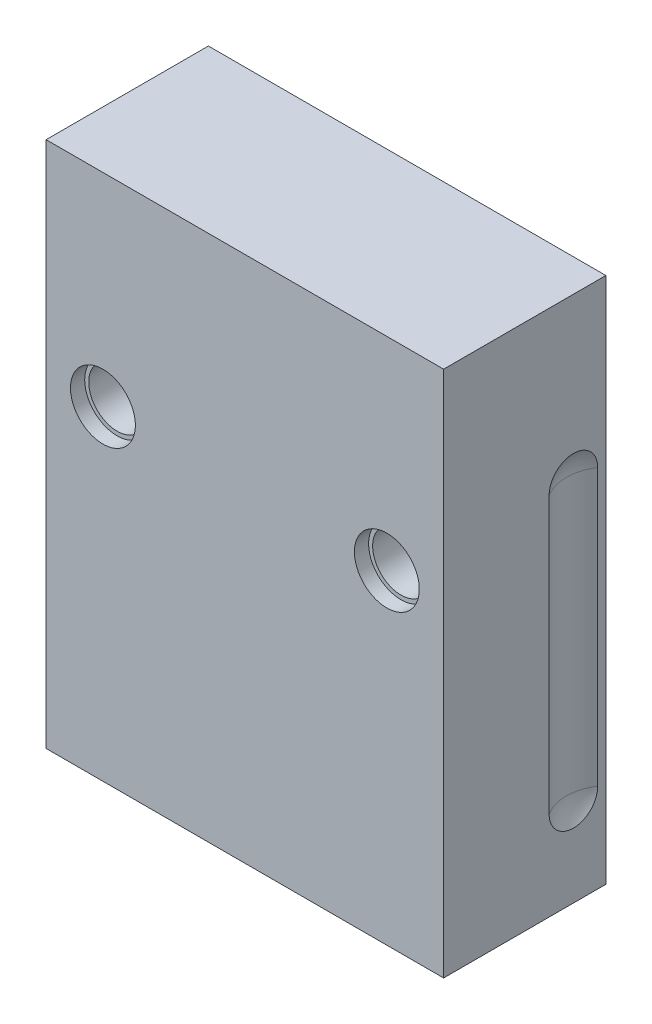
ISO-10303-21;
HEADER;
FILE_DESCRIPTION(('STEP AP214'),'2;1');
FILE_NAME('part.step','',(''),(''),'','','');
FILE_SCHEMA(('AUTOMOTIVE_DESIGN { 1 0 10303 214 1 1 1 1 }'));
ENDSEC;
DATA;
#1=APPLICATION_CONTEXT('core data for automotive mechanical design processes');
#2=APPLICATION_PROTOCOL_DEFINITION('international standard','automotive_design',2000,#1);
#3=PRODUCT_CONTEXT('',#1,'mechanical');
#4=PRODUCT('Part','Part','',(#3));
#5=PRODUCT_RELATED_PRODUCT_CATEGORY('part','',(#4));
#6=PRODUCT_DEFINITION_FORMATION('','',#4);
#7=PRODUCT_DEFINITION_CONTEXT('part definition',#1,'design');
#8=PRODUCT_DEFINITION('design','',#6,#7);
#9=PRODUCT_DEFINITION_SHAPE('','',#8);
#10=(LENGTH_UNIT() NAMED_UNIT(*) SI_UNIT(.MILLI.,.METRE.));
#11=(NAMED_UNIT(*) PLANE_ANGLE_UNIT() SI_UNIT($,.RADIAN.));
#12=(NAMED_UNIT(*) SI_UNIT($,.STERADIAN.) SOLID_ANGLE_UNIT());
#13=UNCERTAINTY_MEASURE_WITH_UNIT(LENGTH_MEASURE(1.E-05),#10,'distance_accuracy_value','');
#14=(GEOMETRIC_REPRESENTATION_CONTEXT(3) GLOBAL_UNCERTAINTY_ASSIGNED_CONTEXT((#13)) GLOBAL_UNIT_ASSIGNED_CONTEXT((#10,
#11,#12)) REPRESENTATION_CONTEXT('',''));
#15=CARTESIAN_POINT('',(0.,0.,0.));
#16=DIRECTION('',(0.,0.,1.));
#17=DIRECTION('',(1.,0.,0.));
#18=AXIS2_PLACEMENT_3D('',#15,#16,#17);
#19=CARTESIAN_POINT('',(13.9999999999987,335.999999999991,8.));
#20=DIRECTION('',(0.,0.,-1.));
#21=DIRECTION('',(-1.,0.,0.));
#22=AXIS2_PLACEMENT_3D('',#19,#20,#21);
#23=CYLINDRICAL_SURFACE('',#22,4.2);
#24=CARTESIAN_POINT('',(13.9999999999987,335.999999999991,-5.));
#25=DIRECTION('',(0.,0.,-1.));
#26=DIRECTION('',(-1.,0.,0.));
#27=AXIS2_PLACEMENT_3D('',#24,#25,#26);
#28=CIRCLE('',#27,4.2);
#29=CARTESIAN_POINT('',(9.79999999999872,335.999999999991,-5.));
#30=VERTEX_POINT('',#29);
#31=EDGE_CURVE('E18',#30,#30,#28,.T.);
#32=ORIENTED_EDGE('',*,*,#31,.T.);
#33=EDGE_LOOP('',(#32));
#34=FACE_BOUND('',#33,.T.);
#35=CARTESIAN_POINT('',(13.9999999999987,335.999999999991,6.61435935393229));
#36=DIRECTION('',(0.,0.,1.));
#37=DIRECTION('',(-1.,0.,0.));
#38=AXIS2_PLACEMENT_3D('',#35,#36,#37);
#39=CIRCLE('',#38,4.20000000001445);
#40=CARTESIAN_POINT('',(9.79999999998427,335.999999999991,6.61435935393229));
#41=VERTEX_POINT('',#40);
#42=EDGE_CURVE('E669',#41,#41,#39,.T.);
#43=ORIENTED_EDGE('',*,*,#42,.T.);
#44=EDGE_LOOP('',(#43));
#45=FACE_BOUND('',#44,.T.);
#46=ADVANCED_FACE('F14',(#34,#45),#23,.F.);
#47=CARTESIAN_POINT('',(83.9999999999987,335.999999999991,8.0000000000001));
#48=DIRECTION('',(0.,0.,-1.));
#49=DIRECTION('',(-1.,0.,0.));
#50=AXIS2_PLACEMENT_3D('',#47,#48,#49);
#51=CYLINDRICAL_SURFACE('',#50,4.2);
#52=CARTESIAN_POINT('',(83.9999999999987,335.999999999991,-5.));
#53=DIRECTION('',(0.,0.,-1.));
#54=DIRECTION('',(-1.,0.,0.));
#55=AXIS2_PLACEMENT_3D('',#52,#53,#54);
#56=CIRCLE('',#55,4.2);
#57=CARTESIAN_POINT('',(79.7999999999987,335.999999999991,-5.));
#58=VERTEX_POINT('',#57);
#59=EDGE_CURVE('E677',#58,#58,#56,.T.);
#60=ORIENTED_EDGE('',*,*,#59,.T.);
#61=EDGE_LOOP('',(#60));
#62=FACE_BOUND('',#61,.T.);
#63=CARTESIAN_POINT('',(83.9999999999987,335.999999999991,6.61435935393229));
#64=DIRECTION('',(0.,0.,1.));
#65=DIRECTION('',(-1.,0.,0.));
#66=AXIS2_PLACEMENT_3D('',#63,#64,#65);
#67=CIRCLE('',#66,4.1999999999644);
#68=CARTESIAN_POINT('',(79.8000000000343,335.999999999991,6.61435935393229));
#69=VERTEX_POINT('',#68);
#70=EDGE_CURVE('E671',#69,#69,#67,.T.);
#71=ORIENTED_EDGE('',*,*,#70,.T.);
#72=EDGE_LOOP('',(#71));
#73=FACE_BOUND('',#72,.T.);
#74=ADVANCED_FACE('F331',(#62,#73),#51,.F.);
#75=CARTESIAN_POINT('',(83.9999999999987,335.999999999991,7.99999999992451));
#76=DIRECTION('',(0.,0.,1.));
#77=DIRECTION('',(1.,0.,0.));
#78=AXIS2_PLACEMENT_3D('',#75,#76,#77);
#79=CONICAL_SURFACE('',#78,4.99999999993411,0.523598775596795);
#80=CARTESIAN_POINT('',(83.9999999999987,335.999999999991,8.0000000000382));
#81=DIRECTION('',(0.,0.,1.));
#82=DIRECTION('',(1.,0.,0.));
#83=AXIS2_PLACEMENT_3D('',#80,#81,#82);
#84=CIRCLE('',#83,4.99999999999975);
#85=CARTESIAN_POINT('',(88.9999999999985,335.999999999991,8.0000000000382));
#86=VERTEX_POINT('',#85);
#87=EDGE_CURVE('E680',#86,#86,#84,.T.);
#88=ORIENTED_EDGE('',*,*,#87,.T.);
#89=EDGE_LOOP('',(#88));
#90=FACE_BOUND('',#89,.T.);
#91=ORIENTED_EDGE('',*,*,#70,.F.);
#92=EDGE_LOOP('',(#91));
#93=FACE_BOUND('',#92,.T.);
#94=ADVANCED_FACE('F327',(#90,#93),#79,.F.);
#95=CARTESIAN_POINT('',(13.9999999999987,335.999999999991,7.99999999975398));
#96=DIRECTION('',(0.,0.,1.));
#97=DIRECTION('',(1.,0.,0.));
#98=AXIS2_PLACEMENT_3D('',#95,#96,#97);
#99=CONICAL_SURFACE('',#98,4.99999999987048,0.523598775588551);
#100=CARTESIAN_POINT('',(13.9999999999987,335.999999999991,7.99999999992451));
#101=DIRECTION('',(0.,0.,1.));
#102=DIRECTION('',(1.,0.,0.));
#103=AXIS2_PLACEMENT_3D('',#100,#101,#102);
#104=CIRCLE('',#103,4.99999999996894);
#105=CARTESIAN_POINT('',(18.9999999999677,335.999999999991,7.99999999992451));
#106=VERTEX_POINT('',#105);
#107=EDGE_CURVE('E277',#106,#106,#104,.T.);
#108=ORIENTED_EDGE('',*,*,#107,.T.);
#109=EDGE_LOOP('',(#108));
#110=FACE_BOUND('',#109,.T.);
#111=ORIENTED_EDGE('',*,*,#42,.F.);
#112=EDGE_LOOP('',(#111));
#113=FACE_BOUND('',#112,.T.);
#114=ADVANCED_FACE('F324',(#110,#113),#99,.F.);
#115=CARTESIAN_POINT('',(14.0000000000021,335.999999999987,-5.));
#116=DIRECTION('',(0.,0.,1.));
#117=DIRECTION('',(0.,-1.,0.));
#118=AXIS2_PLACEMENT_3D('',#115,#116,#117);
#119=PLANE('',#118);
#120=DIRECTION('',(0.707106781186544,0.707106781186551,0.));
#121=VECTOR('',#120,1.);
#122=CARTESIAN_POINT('',(15.8624093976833,330.296366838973,-4.99999999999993));
#123=LINE('',#122,#121);
#124=CARTESIAN_POINT('',(15.8624093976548,330.296366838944,-4.99999999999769));
#125=VERTEX_POINT('',#124);
#126=CARTESIAN_POINT('',(19.1000000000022,333.533957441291,-5.));
#127=VERTEX_POINT('',#126);
#128=EDGE_CURVE('E263',#125,#127,#123,.T.);
#129=ORIENTED_EDGE('',*,*,#128,.F.);
#130=CARTESIAN_POINT('',(14.0000000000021,335.999999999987,-4.99999999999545));
#131=DIRECTION('',(0.,0.,1.));
#132=DIRECTION('',(1.,0.,0.));
#133=AXIS2_PLACEMENT_3D('',#130,#131,#132);
#134=CIRCLE('',#133,6.00000000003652);
#135=CARTESIAN_POINT('',(12.1375906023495,330.296366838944,-4.99999999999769));
#136=VERTEX_POINT('',#135);
#137=EDGE_CURVE('E268',#136,#125,#134,.T.);
#138=ORIENTED_EDGE('',*,*,#137,.F.);
#139=DIRECTION('',(0.70710678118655,-0.707106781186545,0.));
#140=VECTOR('',#139,1.);
#141=CARTESIAN_POINT('',(8.90000000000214,333.533957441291,-5.));
#142=LINE('',#141,#140);
#143=CARTESIAN_POINT('',(8.90000000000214,333.533957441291,-5.));
#144=VERTEX_POINT('',#143);
#145=EDGE_CURVE('E285',#144,#136,#142,.T.);
#146=ORIENTED_EDGE('',*,*,#145,.F.);
#147=DIRECTION('',(0.,1.,0.));
#148=VECTOR('',#147,1.);
#149=CARTESIAN_POINT('',(8.90000000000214,337.100265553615,-5.));
#150=LINE('',#149,#148);
#151=CARTESIAN_POINT('',(8.90000000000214,338.466042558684,-4.99999999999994));
#152=VERTEX_POINT('',#151);
#153=EDGE_CURVE('E652',#152,#144,#150,.F.);
#154=ORIENTED_EDGE('',*,*,#153,.F.);
#155=DIRECTION('',(-0.707106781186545,-0.70710678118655,0.));
#156=VECTOR('',#155,1.);
#157=CARTESIAN_POINT('',(12.1375906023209,341.703633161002,-4.99999999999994));
#158=LINE('',#157,#156);
#159=CARTESIAN_POINT('',(12.1375906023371,341.703633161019,-5.00000000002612));
#160=VERTEX_POINT('',#159);
#161=EDGE_CURVE('E639',#160,#152,#158,.T.);
#162=ORIENTED_EDGE('',*,*,#161,.F.);
#163=CARTESIAN_POINT('',(14.0000000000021,335.999999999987,-5.00000000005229));
#164=DIRECTION('',(0.,0.,1.));
#165=DIRECTION('',(1.,0.,0.));
#166=AXIS2_PLACEMENT_3D('',#163,#164,#165);
#167=CIRCLE('',#166,6.00000000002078);
#168=CARTESIAN_POINT('',(15.8624093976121,341.703633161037,-5.00000000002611));
#169=VERTEX_POINT('',#168);
#170=EDGE_CURVE('E726',#169,#160,#167,.T.);
#171=ORIENTED_EDGE('',*,*,#170,.F.);
#172=DIRECTION('',(-0.707106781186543,0.707106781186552,0.));
#173=VECTOR('',#172,1.);
#174=CARTESIAN_POINT('',(19.1000000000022,338.466042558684,-5.));
#175=LINE('',#174,#173);
#176=CARTESIAN_POINT('',(19.1000000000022,338.466042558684,-5.));
#177=VERTEX_POINT('',#176);
#178=EDGE_CURVE('E729',#177,#169,#175,.T.);
#179=ORIENTED_EDGE('',*,*,#178,.F.);
#180=DIRECTION('',(0.,1.,0.));
#181=VECTOR('',#180,1.);
#182=CARTESIAN_POINT('',(19.1000000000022,337.100265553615,-5.));
#183=LINE('',#182,#181);
#184=EDGE_CURVE('E271',#127,#177,#183,.T.);
#185=ORIENTED_EDGE('',*,*,#184,.F.);
#186=EDGE_LOOP('',(#129,#138,#146,#154,#162,#171,#179,#185));
#187=FACE_BOUND('',#186,.T.);
#188=ORIENTED_EDGE('',*,*,#31,.F.);
#189=EDGE_LOOP('',(#188));
#190=FACE_BOUND('',#189,.T.);
#191=ADVANCED_FACE('F265',(#187,#190),#119,.F.);
#192=CARTESIAN_POINT('',(83.9999999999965,335.999999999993,-5.));
#193=DIRECTION('',(0.,0.,1.));
#194=DIRECTION('',(0.,-1.,0.));
#195=AXIS2_PLACEMENT_3D('',#192,#193,#194);
#196=PLANE('',#195);
#197=DIRECTION('',(-0.707106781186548,-0.707106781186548,0.));
#198=VECTOR('',#197,1.);
#199=CARTESIAN_POINT('',(82.1375906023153,341.703633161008,-5.));
#200=LINE('',#199,#198);
#201=CARTESIAN_POINT('',(82.1375906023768,341.703633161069,-4.99999999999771));
#202=VERTEX_POINT('',#201);
#203=CARTESIAN_POINT('',(78.2963668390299,337.862409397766,-4.99999999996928));
#204=VERTEX_POINT('',#203);
#205=EDGE_CURVE('E803',#202,#204,#200,.T.);
#206=ORIENTED_EDGE('',*,*,#205,.F.);
#207=CARTESIAN_POINT('',(83.9999999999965,335.999999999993,-4.99999999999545));
#208=DIRECTION('',(0.,0.,1.));
#209=DIRECTION('',(1.,0.,0.));
#210=AXIS2_PLACEMENT_3D('',#207,#208,#209);
#211=CIRCLE('',#210,6.0000000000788);
#212=CARTESIAN_POINT('',(85.8624093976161,341.703633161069,-4.99999999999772));
#213=VERTEX_POINT('',#212);
#214=EDGE_CURVE('E802',#213,#202,#211,.T.);
#215=ORIENTED_EDGE('',*,*,#214,.F.);
#216=DIRECTION('',(-0.707106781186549,0.707106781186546,0.));
#217=VECTOR('',#216,1.);
#218=CARTESIAN_POINT('',(89.7036331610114,337.862409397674,-5.));
#219=LINE('',#218,#217);
#220=CARTESIAN_POINT('',(89.7036331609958,337.862409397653,-5.00000000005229));
#221=VERTEX_POINT('',#220);
#222=EDGE_CURVE('E445',#221,#213,#219,.T.);
#223=ORIENTED_EDGE('',*,*,#222,.F.);
#224=CARTESIAN_POINT('',(83.9999999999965,335.999999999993,-5.0000000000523));
#225=DIRECTION('',(0.,0.,1.));
#226=DIRECTION('',(1.,0.,0.));
#227=AXIS2_PLACEMENT_3D('',#224,#225,#226);
#228=CIRCLE('',#227,5.9999999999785);
#229=CARTESIAN_POINT('',(89.7036331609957,334.137590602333,-5.00000000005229));
#230=VERTEX_POINT('',#229);
#231=EDGE_CURVE('E628',#230,#221,#228,.T.);
#232=ORIENTED_EDGE('',*,*,#231,.F.);
#233=DIRECTION('',(0.707106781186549,0.707106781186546,0.));
#234=VECTOR('',#233,1.);
#235=CARTESIAN_POINT('',(85.8624093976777,330.296366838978,-5.));
#236=LINE('',#235,#234);
#237=CARTESIAN_POINT('',(85.8624093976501,330.296366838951,-4.99999999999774));
#238=VERTEX_POINT('',#237);
#239=EDGE_CURVE('E731',#238,#230,#236,.T.);
#240=ORIENTED_EDGE('',*,*,#239,.F.);
#241=CARTESIAN_POINT('',(83.9999999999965,335.999999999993,-4.99999999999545));
#242=DIRECTION('',(0.,0.,1.));
#243=DIRECTION('',(1.,0.,0.));
#244=AXIS2_PLACEMENT_3D('',#241,#242,#243);
#245=CIRCLE('',#244,6.00000000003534);
#246=CARTESIAN_POINT('',(82.1375906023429,330.296366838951,-4.99999999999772));
#247=VERTEX_POINT('',#246);
#248=EDGE_CURVE('E740',#247,#238,#245,.T.);
#249=ORIENTED_EDGE('',*,*,#248,.F.);
#250=DIRECTION('',(0.707106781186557,-0.707106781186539,0.));
#251=VECTOR('',#250,1.);
#252=CARTESIAN_POINT('',(78.2963668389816,334.137590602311,-5.));
#253=LINE('',#252,#251);
#254=CARTESIAN_POINT('',(78.2963668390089,334.137590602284,-4.9999999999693));
#255=VERTEX_POINT('',#254);
#256=EDGE_CURVE('E770',#255,#247,#253,.T.);
#257=ORIENTED_EDGE('',*,*,#256,.F.);
#258=CARTESIAN_POINT('',(83.9999999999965,335.999999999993,-4.99999999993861));
#259=DIRECTION('',(0.,0.,1.));
#260=DIRECTION('',(1.,0.,0.));
#261=AXIS2_PLACEMENT_3D('',#258,#259,#260);
#262=CIRCLE('',#261,5.99999999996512);
#263=EDGE_CURVE('E791',#204,#255,#262,.T.);
#264=ORIENTED_EDGE('',*,*,#263,.F.);
#265=EDGE_LOOP('',(#206,#215,#223,#232,#240,#249,#257,#264));
#266=FACE_BOUND('',#265,.T.);
#267=ORIENTED_EDGE('',*,*,#59,.F.);
#268=EDGE_LOOP('',(#267));
#269=FACE_BOUND('',#268,.T.);
#270=ADVANCED_FACE('F317',(#266,#269),#196,.F.);
#271=CARTESIAN_POINT('',(83.9999999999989,335.999999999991,8.0000000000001));
#272=DIRECTION('',(0.,0.,-1.));
#273=DIRECTION('',(-1.,0.,0.));
#274=AXIS2_PLACEMENT_3D('',#271,#272,#273);
#275=PLANE('',#274);
#276=CARTESIAN_POINT('',(83.9999999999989,335.999999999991,8.0000000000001));
#277=DIRECTION('',(0.,0.,1.));
#278=DIRECTION('',(1.,0.,0.));
#279=AXIS2_PLACEMENT_3D('',#276,#277,#278);
#280=CIRCLE('',#279,7.);
#281=CARTESIAN_POINT('',(90.9999999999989,335.999999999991,8.0000000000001));
#282=VERTEX_POINT('',#281);
#283=EDGE_CURVE('E969',#282,#282,#280,.T.);
#284=ORIENTED_EDGE('',*,*,#283,.T.);
#285=EDGE_LOOP('',(#284));
#286=FACE_BOUND('',#285,.T.);
#287=ORIENTED_EDGE('',*,*,#87,.F.);
#288=EDGE_LOOP('',(#287));
#289=FACE_BOUND('',#288,.T.);
#290=ADVANCED_FACE('F313',(#286,#289),#275,.F.);
#291=CARTESIAN_POINT('',(13.9999999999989,335.999999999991,8.));
#292=DIRECTION('',(0.,0.,-1.));
#293=DIRECTION('',(-1.,0.,0.));
#294=AXIS2_PLACEMENT_3D('',#291,#292,#293);
#295=PLANE('',#294);
#296=CARTESIAN_POINT('',(13.9999999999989,335.999999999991,8.));
#297=DIRECTION('',(0.,0.,1.));
#298=DIRECTION('',(1.,0.,0.));
#299=AXIS2_PLACEMENT_3D('',#296,#297,#298);
#300=CIRCLE('',#299,7.);
#301=CARTESIAN_POINT('',(20.9999999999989,335.999999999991,8.));
#302=VERTEX_POINT('',#301);
#303=EDGE_CURVE('E658',#302,#302,#300,.T.);
#304=ORIENTED_EDGE('',*,*,#303,.T.);
#305=EDGE_LOOP('',(#304));
#306=FACE_BOUND('',#305,.T.);
#307=ORIENTED_EDGE('',*,*,#107,.F.);
#308=EDGE_LOOP('',(#307));
#309=FACE_BOUND('',#308,.T.);
#310=ADVANCED_FACE('F309',(#306,#309),#295,.F.);
#311=CARTESIAN_POINT('',(49.4849999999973,316.799999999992,11.6999999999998));
#312=DIRECTION('',(0.,0.,1.));
#313=DIRECTION('',(1.,0.,0.));
#314=AXIS2_PLACEMENT_3D('',#311,#312,#313);
#315=PLANE('',#314);
#316=DIRECTION('',(1.,0.,0.));
#317=VECTOR('',#316,1.);
#318=CARTESIAN_POINT('',(48.9999999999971,339.999999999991,11.7));
#319=LINE('',#318,#317);
#320=CARTESIAN_POINT('',(55.9999999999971,339.999999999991,11.7));
#321=VERTEX_POINT('',#320);
#322=CARTESIAN_POINT('',(41.9999999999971,339.999999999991,11.7));
#323=VERTEX_POINT('',#322);
#324=EDGE_CURVE('E585',#321,#323,#319,.F.);
#325=ORIENTED_EDGE('',*,*,#324,.F.);
#326=CARTESIAN_POINT('',(55.9999999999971,334.999999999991,11.7));
#327=DIRECTION('',(0.,0.,-1.));
#328=DIRECTION('',(-1.,0.,0.));
#329=AXIS2_PLACEMENT_3D('',#326,#327,#328);
#330=CIRCLE('',#329,5.);
#331=CARTESIAN_POINT('',(60.9999999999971,334.999999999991,11.7));
#332=VERTEX_POINT('',#331);
#333=EDGE_CURVE('E582',#332,#321,#330,.F.);
#334=ORIENTED_EDGE('',*,*,#333,.F.);
#335=DIRECTION('',(0.,1.,0.));
#336=VECTOR('',#335,1.);
#337=CARTESIAN_POINT('',(60.9999999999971,313.199999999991,11.7));
#338=LINE('',#337,#336);
#339=CARTESIAN_POINT('',(60.9999999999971,291.399999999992,11.7));
#340=VERTEX_POINT('',#339);
#341=EDGE_CURVE('E574',#340,#332,#338,.T.);
#342=ORIENTED_EDGE('',*,*,#341,.F.);
#343=CARTESIAN_POINT('',(55.9999999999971,291.399999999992,11.7));
#344=DIRECTION('',(0.,0.,-1.));
#345=DIRECTION('',(-1.,0.,0.));
#346=AXIS2_PLACEMENT_3D('',#343,#344,#345);
#347=CIRCLE('',#346,5.);
#348=CARTESIAN_POINT('',(55.9999999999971,286.399999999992,11.7));
#349=VERTEX_POINT('',#348);
#350=EDGE_CURVE('E577',#349,#340,#347,.F.);
#351=ORIENTED_EDGE('',*,*,#350,.F.);
#352=DIRECTION('',(1.,0.,0.));
#353=VECTOR('',#352,1.);
#354=CARTESIAN_POINT('',(48.9999999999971,286.399999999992,11.7));
#355=LINE('',#354,#353);
#356=CARTESIAN_POINT('',(41.9999999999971,286.399999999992,11.7));
#357=VERTEX_POINT('',#356);
#358=EDGE_CURVE('E656',#357,#349,#355,.T.);
#359=ORIENTED_EDGE('',*,*,#358,.F.);
#360=CARTESIAN_POINT('',(41.9999999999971,291.399999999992,11.7));
#361=DIRECTION('',(0.,0.,-1.));
#362=DIRECTION('',(-1.,0.,0.));
#363=AXIS2_PLACEMENT_3D('',#360,#361,#362);
#364=CIRCLE('',#363,5.);
#365=CARTESIAN_POINT('',(36.9999999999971,291.399999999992,11.7));
#366=VERTEX_POINT('',#365);
#367=EDGE_CURVE('E594',#366,#357,#364,.F.);
#368=ORIENTED_EDGE('',*,*,#367,.F.);
#369=DIRECTION('',(0.,1.,0.));
#370=VECTOR('',#369,1.);
#371=CARTESIAN_POINT('',(36.9999999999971,313.199999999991,11.7));
#372=LINE('',#371,#370);
#373=CARTESIAN_POINT('',(36.9999999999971,334.999999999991,11.7));
#374=VERTEX_POINT('',#373);
#375=EDGE_CURVE('E591',#374,#366,#372,.F.);
#376=ORIENTED_EDGE('',*,*,#375,.F.);
#377=CARTESIAN_POINT('',(41.9999999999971,334.999999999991,11.7));
#378=DIRECTION('',(0.,0.,-1.));
#379=DIRECTION('',(-1.,0.,0.));
#380=AXIS2_PLACEMENT_3D('',#377,#378,#379);
#381=CIRCLE('',#380,5.);
#382=EDGE_CURVE('E588',#323,#374,#381,.F.);
#383=ORIENTED_EDGE('',*,*,#382,.F.);
#384=EDGE_LOOP('',(#325,#334,#342,#351,#359,#368,#376,#383));
#385=FACE_BOUND('',#384,.T.);
#386=ADVANCED_FACE('F306',(#385),#315,.F.);
#387=CARTESIAN_POINT('',(19.1780579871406,332.904908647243,-4.49999999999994));
#388=DIRECTION('',(0.5,-0.5,-0.707106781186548));
#389=DIRECTION('',(-0.816496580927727,0.,-0.577350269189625));
#390=AXIS2_PLACEMENT_3D('',#387,#388,#389);
#391=PLANE('',#390);
#392=CARTESIAN_POINT('',(15.8624093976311,330.296366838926,-4.99999999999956));
#393=CARTESIAN_POINT('',(15.9520100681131,330.150510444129,-4.83350671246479));
#394=CARTESIAN_POINT('',(16.042206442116,330.005127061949,-4.66692666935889));
#395=CARTESIAN_POINT('',(16.2237904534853,329.715306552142,-4.33359333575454));
#396=CARTESIAN_POINT('',(16.3151780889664,329.570869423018,-4.16684004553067));
#397=CARTESIAN_POINT('',(16.407161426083,329.426905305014,-4.00000000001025));
#398=B_SPLINE_CURVE_WITH_KNOTS('',3,(#392,#393,#394,#395,#396,#397),.UNSPECIFIED.,.F.,.F.,(4,2,
4),(0.,0.716369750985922,1.43273836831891),.UNSPECIFIED.);
#399=CARTESIAN_POINT('',(16.4071614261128,329.426905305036,-4.00000000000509));
#400=VERTEX_POINT('',#399);
#401=EDGE_CURVE('E276',#125,#400,#398,.T.);
#402=ORIENTED_EDGE('',*,*,#401,.F.);
#403=ORIENTED_EDGE('',*,*,#128,.T.);
#404=DIRECTION('',(-0.678598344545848,0.281084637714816,-0.678598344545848));
#405=VECTOR('',#404,1.);
#406=CARTESIAN_POINT('',(20.1000000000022,333.119743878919,-3.99999999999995));
#407=LINE('',#406,#405);
#408=CARTESIAN_POINT('',(20.1000000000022,333.119743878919,-3.99999999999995));
#409=VERTEX_POINT('',#408);
#410=EDGE_CURVE('E621',#409,#127,#407,.T.);
#411=ORIENTED_EDGE('',*,*,#410,.F.);
#412=DIRECTION('',(0.707106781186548,0.707106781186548,0.));
#413=VECTOR('',#412,1.);
#414=CARTESIAN_POINT('',(20.573094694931,333.592838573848,-3.99999999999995));
#415=LINE('',#414,#413);
#416=EDGE_CURVE('E289',#400,#409,#415,.T.);
#417=ORIENTED_EDGE('',*,*,#416,.F.);
#418=EDGE_LOOP('',(#402,#403,#411,#417));
#419=FACE_BOUND('',#418,.T.);
#420=ADVANCED_FACE('F288',(#419),#391,.T.);
#421=CARTESIAN_POINT('',(14.0000000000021,335.999999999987,-4.0000000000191));
#422=DIRECTION('',(0.,0.,1.));
#423=DIRECTION('',(1.,0.,0.));
#424=AXIS2_PLACEMENT_3D('',#421,#422,#423);
#425=CONICAL_SURFACE('',#424,7.00000000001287,0.785398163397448);
#426=CARTESIAN_POINT('',(12.137590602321,330.296366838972,-4.99999999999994));
#427=CARTESIAN_POINT('',(11.8795414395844,329.875962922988,-4.52026122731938));
#428=CARTESIAN_POINT('',(11.5928385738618,329.426905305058,-3.99999999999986));
#429=B_SPLINE_CURVE_WITH_KNOTS('',2,(#426,#427,#428),.UNSPECIFIED.,.F.,.F.,(3,3),(0.,1.),.UNSPECIFIED.);
#430=CARTESIAN_POINT('',(11.5928385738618,329.426905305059,-3.99999999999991));
#431=VERTEX_POINT('',#430);
#432=EDGE_CURVE('E284',#136,#431,#429,.T.);
#433=ORIENTED_EDGE('',*,*,#432,.F.);
#434=ORIENTED_EDGE('',*,*,#137,.T.);
#435=ORIENTED_EDGE('',*,*,#401,.T.);
#436=CARTESIAN_POINT('',(14.0000000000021,335.999999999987,-3.99999999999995));
#437=DIRECTION('',(0.,0.,1.));
#438=DIRECTION('',(1.,0.,0.));
#439=AXIS2_PLACEMENT_3D('',#436,#437,#438);
#440=CIRCLE('',#439,7.);
#441=EDGE_CURVE('E565',#431,#400,#440,.T.);
#442=ORIENTED_EDGE('',*,*,#441,.F.);
#443=EDGE_LOOP('',(#433,#434,#435,#442));
#444=FACE_BOUND('',#443,.T.);
#445=ADVANCED_FACE('F281',(#444),#425,.T.);
#446=CARTESIAN_POINT('',(10.9049086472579,330.821942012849,-4.49999999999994));
#447=DIRECTION('',(-0.5,-0.5,-0.707106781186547));
#448=DIRECTION('',(0.,0.816496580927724,-0.577350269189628));
#449=AXIS2_PLACEMENT_3D('',#446,#447,#448);
#450=PLANE('',#449);
#451=ORIENTED_EDGE('',*,*,#432,.T.);
#452=DIRECTION('',(0.707106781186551,-0.707106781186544,0.));
#453=VECTOR('',#452,1.);
#454=CARTESIAN_POINT('',(11.5928385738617,329.426905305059,-3.99999999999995));
#455=LINE('',#454,#453);
#456=CARTESIAN_POINT('',(7.90000000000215,333.119743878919,-3.99999999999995));
#457=VERTEX_POINT('',#456);
#458=EDGE_CURVE('E562',#457,#431,#455,.T.);
#459=ORIENTED_EDGE('',*,*,#458,.F.);
#460=DIRECTION('',(-0.67859834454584,-0.281084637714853,0.678598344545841));
#461=VECTOR('',#460,1.);
#462=CARTESIAN_POINT('',(8.90000000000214,333.533957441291,-5.));
#463=LINE('',#462,#461);
#464=EDGE_CURVE('E640',#144,#457,#463,.T.);
#465=ORIENTED_EDGE('',*,*,#464,.F.);
#466=ORIENTED_EDGE('',*,*,#145,.T.);
#467=EDGE_LOOP('',(#451,#459,#465,#466));
#468=FACE_BOUND('',#467,.T.);
#469=ADVANCED_FACE('F700',(#468),#450,.T.);
#470=CARTESIAN_POINT('',(8.33002133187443,337.100265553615,-4.43002133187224));
#471=DIRECTION('',(-0.707106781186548,0.,-0.707106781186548));
#472=DIRECTION('',(-0.707106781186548,0.,0.707106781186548));
#473=AXIS2_PLACEMENT_3D('',#470,#471,#472);
#474=PLANE('',#473);
#475=ORIENTED_EDGE('',*,*,#153,.T.);
#476=ORIENTED_EDGE('',*,*,#464,.T.);
#477=DIRECTION('',(0.,-1.,0.));
#478=VECTOR('',#477,1.);
#479=CARTESIAN_POINT('',(7.90000000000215,335.999999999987,-3.99999999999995));
#480=LINE('',#479,#478);
#481=CARTESIAN_POINT('',(7.90000000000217,338.880256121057,-3.99999999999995));
#482=VERTEX_POINT('',#481);
#483=EDGE_CURVE('E557',#482,#457,#480,.T.);
#484=ORIENTED_EDGE('',*,*,#483,.F.);
#485=DIRECTION('',(-0.678598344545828,0.281084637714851,0.678598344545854));
#486=VECTOR('',#485,1.);
#487=CARTESIAN_POINT('',(8.90000000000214,338.466042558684,-4.99999999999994));
#488=LINE('',#487,#486);
#489=EDGE_CURVE('E637',#152,#482,#488,.T.);
#490=ORIENTED_EDGE('',*,*,#489,.F.);
#491=EDGE_LOOP('',(#475,#476,#484,#490));
#492=FACE_BOUND('',#491,.T.);
#493=ADVANCED_FACE('F709',(#492),#474,.T.);
#494=CARTESIAN_POINT('',(8.82194201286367,339.095091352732,-4.49999999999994));
#495=DIRECTION('',(-0.5,0.5,-0.707106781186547));
#496=DIRECTION('',(-0.816496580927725,0.,0.577350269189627));
#497=AXIS2_PLACEMENT_3D('',#494,#495,#496);
#498=PLANE('',#497);
#499=CARTESIAN_POINT('',(12.1375906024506,341.703633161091,-5.00000000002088));
#500=CARTESIAN_POINT('',(12.0479899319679,341.849489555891,-4.83350671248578));
#501=CARTESIAN_POINT('',(11.9577935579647,341.994872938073,-4.66692666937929));
#502=CARTESIAN_POINT('',(11.7762095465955,342.284693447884,-4.3335933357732));
#503=CARTESIAN_POINT('',(11.6848219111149,342.42913057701,-4.16684004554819));
#504=CARTESIAN_POINT('',(11.5928385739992,342.573094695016,-4.00000000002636));
#505=B_SPLINE_CURVE_WITH_KNOTS('',3,(#499,#500,#501,#502,#503,#504),.UNSPECIFIED.,.F.,.F.,(4,2,
4),(0.,0.716369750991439,1.43273836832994),.UNSPECIFIED.);
#506=CARTESIAN_POINT('',(11.5928385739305,342.573094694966,-4.00000000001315));
#507=VERTEX_POINT('',#506);
#508=EDGE_CURVE('E720',#160,#507,#505,.T.);
#509=ORIENTED_EDGE('',*,*,#508,.F.);
#510=ORIENTED_EDGE('',*,*,#161,.T.);
#511=ORIENTED_EDGE('',*,*,#489,.T.);
#512=DIRECTION('',(-0.707106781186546,-0.707106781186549,0.));
#513=VECTOR('',#512,1.);
#514=CARTESIAN_POINT('',(7.42690530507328,338.407161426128,-3.99999999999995));
#515=LINE('',#514,#513);
#516=EDGE_CURVE('E545',#507,#482,#515,.T.);
#517=ORIENTED_EDGE('',*,*,#516,.F.);
#518=EDGE_LOOP('',(#509,#510,#511,#517));
#519=FACE_BOUND('',#518,.T.);
#520=ADVANCED_FACE('F712',(#519),#498,.T.);
#521=CARTESIAN_POINT('',(14.0000000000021,335.999999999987,-4.00000000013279));
#522=DIRECTION('',(0.,0.,1.));
#523=DIRECTION('',(1.,0.,0.));
#524=AXIS2_PLACEMENT_3D('',#521,#522,#523);
#525=CONICAL_SURFACE('',#524,6.99999999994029,0.785398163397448);
#526=CARTESIAN_POINT('',(15.8624093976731,341.703633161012,-5.00000000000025));
#527=CARTESIAN_POINT('',(16.1204585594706,342.124037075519,-4.52026122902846));
#528=CARTESIAN_POINT('',(16.4071614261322,342.573094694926,-4.00000000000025));
#529=B_SPLINE_CURVE_WITH_KNOTS('',2,(#526,#527,#528),.UNSPECIFIED.,.F.,.F.,(3,3),(0.,1.),.UNSPECIFIED.);
#530=CARTESIAN_POINT('',(16.4071614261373,342.573094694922,-4.0000000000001));
#531=VERTEX_POINT('',#530);
#532=EDGE_CURVE('E623',#169,#531,#529,.T.);
#533=ORIENTED_EDGE('',*,*,#532,.F.);
#534=ORIENTED_EDGE('',*,*,#170,.T.);
#535=ORIENTED_EDGE('',*,*,#508,.T.);
#536=CARTESIAN_POINT('',(14.0000000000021,335.999999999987,-3.99999999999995));
#537=DIRECTION('',(0.,0.,1.));
#538=DIRECTION('',(1.,0.,0.));
#539=AXIS2_PLACEMENT_3D('',#536,#537,#538);
#540=CIRCLE('',#539,7.);
#541=EDGE_CURVE('E542',#531,#507,#540,.T.);
#542=ORIENTED_EDGE('',*,*,#541,.F.);
#543=EDGE_LOOP('',(#533,#534,#535,#542));
#544=FACE_BOUND('',#543,.T.);
#545=ADVANCED_FACE('F716',(#544),#525,.T.);
#546=CARTESIAN_POINT('',(17.0950913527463,341.178057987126,-4.49999999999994));
#547=DIRECTION('',(0.5,0.5,-0.707106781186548));
#548=DIRECTION('',(-0.816496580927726,0.,-0.577350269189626));
#549=AXIS2_PLACEMENT_3D('',#546,#547,#548);
#550=PLANE('',#549);
#551=ORIENTED_EDGE('',*,*,#532,.T.);
#552=DIRECTION('',(-0.707106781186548,0.707106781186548,0.));
#553=VECTOR('',#552,1.);
#554=CARTESIAN_POINT('',(16.4071614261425,342.573094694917,-3.99999999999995));
#555=LINE('',#554,#553);
#556=CARTESIAN_POINT('',(20.1000000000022,338.880256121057,-3.99999999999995));
#557=VERTEX_POINT('',#556);
#558=EDGE_CURVE('E527',#557,#531,#555,.T.);
#559=ORIENTED_EDGE('',*,*,#558,.F.);
#560=DIRECTION('',(0.678598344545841,0.28108463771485,0.678598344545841));
#561=VECTOR('',#560,1.);
#562=CARTESIAN_POINT('',(19.1000000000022,338.466042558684,-5.));
#563=LINE('',#562,#561);
#564=EDGE_CURVE('E626',#177,#557,#563,.T.);
#565=ORIENTED_EDGE('',*,*,#564,.F.);
#566=ORIENTED_EDGE('',*,*,#178,.T.);
#567=EDGE_LOOP('',(#551,#559,#565,#566));
#568=FACE_BOUND('',#567,.T.);
#569=ADVANCED_FACE('F1393',(#568),#550,.T.);
#570=CARTESIAN_POINT('',(19.6699786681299,337.100265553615,-4.43002133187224));
#571=DIRECTION('',(0.707106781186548,0.,-0.707106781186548));
#572=DIRECTION('',(-0.707106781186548,0.,-0.707106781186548));
#573=AXIS2_PLACEMENT_3D('',#570,#571,#572);
#574=PLANE('',#573);
#575=ORIENTED_EDGE('',*,*,#184,.T.);
#576=ORIENTED_EDGE('',*,*,#564,.T.);
#577=DIRECTION('',(0.,1.,0.));
#578=VECTOR('',#577,1.);
#579=CARTESIAN_POINT('',(20.1000000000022,335.999999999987,-3.99999999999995));
#580=LINE('',#579,#578);
#581=EDGE_CURVE('E526',#409,#557,#580,.T.);
#582=ORIENTED_EDGE('',*,*,#581,.F.);
#583=ORIENTED_EDGE('',*,*,#410,.T.);
#584=EDGE_LOOP('',(#575,#576,#582,#583));
#585=FACE_BOUND('',#584,.T.);
#586=ADVANCED_FACE('F1385',(#585),#574,.T.);
#587=CARTESIAN_POINT('',(83.9999999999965,335.999999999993,-4.00000000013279));
#588=DIRECTION('',(0.,0.,1.));
#589=DIRECTION('',(1.,0.,0.));
#590=AXIS2_PLACEMENT_3D('',#587,#588,#589);
#591=CONICAL_SURFACE('',#590,6.999999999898,0.785398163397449);
#592=CARTESIAN_POINT('',(89.7036331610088,334.137590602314,-5.00000000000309));
#593=CARTESIAN_POINT('',(90.1240370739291,333.879541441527,-4.5202612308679));
#594=CARTESIAN_POINT('',(90.5730946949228,333.592838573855,-4.00000000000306));
#595=B_SPLINE_CURVE_WITH_KNOTS('',2,(#592,#593,#594),.UNSPECIFIED.,.F.,.F.,(3,3),(0.,1.),.UNSPECIFIED.);
#596=CARTESIAN_POINT('',(90.5730946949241,333.592838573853,-4.0000000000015));
#597=VERTEX_POINT('',#596);
#598=EDGE_CURVE('E741',#230,#597,#595,.T.);
#599=ORIENTED_EDGE('',*,*,#598,.F.);
#600=ORIENTED_EDGE('',*,*,#231,.T.);
#601=CARTESIAN_POINT('',(90.5730946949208,338.407161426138,-4.00000000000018));
#602=CARTESIAN_POINT('',(90.1240370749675,338.120458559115,-4.52026122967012));
#603=CARTESIAN_POINT('',(89.7036331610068,337.862409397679,-5.00000000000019));
#604=B_SPLINE_CURVE_WITH_KNOTS('',2,(#601,#602,#603),.UNSPECIFIED.,.F.,.F.,(3,3),(0.,1.),.UNSPECIFIED.);
#605=CARTESIAN_POINT('',(90.5730946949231,338.407161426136,-4.00000000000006));
#606=VERTEX_POINT('',#605);
#607=EDGE_CURVE('E822',#606,#221,#604,.T.);
#608=ORIENTED_EDGE('',*,*,#607,.F.);
#609=CARTESIAN_POINT('',(83.9999999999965,335.999999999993,-4.));
#610=DIRECTION('',(0.,0.,1.));
#611=DIRECTION('',(1.,0.,0.));
#612=AXIS2_PLACEMENT_3D('',#609,#610,#611);
#613=CIRCLE('',#612,7.);
#614=EDGE_CURVE('E568',#597,#606,#613,.T.);
#615=ORIENTED_EDGE('',*,*,#614,.F.);
#616=EDGE_LOOP('',(#599,#600,#608,#615));
#617=FACE_BOUND('',#616,.T.);
#618=ADVANCED_FACE('F750',(#617),#591,.T.);
#619=CARTESIAN_POINT('',(89.1780579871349,332.904908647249,-4.5));
#620=DIRECTION('',(0.5,-0.5,-0.707106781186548));
#621=DIRECTION('',(-0.816496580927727,0.,-0.577350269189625));
#622=AXIS2_PLACEMENT_3D('',#619,#620,#621);
#623=PLANE('',#622);
#624=ORIENTED_EDGE('',*,*,#598,.T.);
#625=DIRECTION('',(0.707106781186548,0.707106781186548,0.));
#626=VECTOR('',#625,1.);
#627=CARTESIAN_POINT('',(90.5730946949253,333.592838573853,-4.));
#628=LINE('',#627,#626);
#629=CARTESIAN_POINT('',(86.4071614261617,329.426905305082,-3.99999999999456));
#630=VERTEX_POINT('',#629);
#631=EDGE_CURVE('E523',#630,#597,#628,.T.);
#632=ORIENTED_EDGE('',*,*,#631,.F.);
#633=CARTESIAN_POINT('',(85.8624093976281,330.296366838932,-4.99999999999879));
#634=CARTESIAN_POINT('',(85.9520100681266,330.150510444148,-4.83350671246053));
#635=CARTESIAN_POINT('',(86.0422064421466,330.00512706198,-4.66692666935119));
#636=CARTESIAN_POINT('',(86.2237904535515,329.715306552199,-4.33359333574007));
#637=CARTESIAN_POINT('',(86.315178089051,329.570869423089,-4.16684004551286));
#638=CARTESIAN_POINT('',(86.4071614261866,329.426905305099,-3.99999999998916));
#639=B_SPLINE_CURVE_WITH_KNOTS('',3,(#633,#634,#635,#636,#637,#638),.UNSPECIFIED.,.F.,.F.,(4,2,
4),(0.,0.716369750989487,1.43273836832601),.UNSPECIFIED.);
#640=EDGE_CURVE('E732',#238,#630,#639,.T.);
#641=ORIENTED_EDGE('',*,*,#640,.F.);
#642=ORIENTED_EDGE('',*,*,#239,.T.);
#643=EDGE_LOOP('',(#624,#632,#641,#642));
#644=FACE_BOUND('',#643,.T.);
#645=ADVANCED_FACE('F746',(#644),#623,.T.);
#646=CARTESIAN_POINT('',(83.9999999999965,335.999999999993,-3.99999999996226));
#647=DIRECTION('',(0.,0.,1.));
#648=DIRECTION('',(1.,0.,0.));
#649=AXIS2_PLACEMENT_3D('',#646,#647,#648);
#650=CONICAL_SURFACE('',#649,7.00000000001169,0.785398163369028);
#651=CARTESIAN_POINT('',(82.1375906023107,330.296366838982,-4.99999999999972));
#652=CARTESIAN_POINT('',(81.8795414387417,329.875962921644,-4.52026122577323));
#653=CARTESIAN_POINT('',(81.5928385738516,329.426905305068,-3.99999999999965));
#654=B_SPLINE_CURVE_WITH_KNOTS('',2,(#651,#652,#653),.UNSPECIFIED.,.F.,.F.,(3,3),(0.,1.),.UNSPECIFIED.);
#655=CARTESIAN_POINT('',(81.5928385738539,329.426905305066,-3.99999999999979));
#656=VERTEX_POINT('',#655);
#657=EDGE_CURVE('E766',#247,#656,#654,.T.);
#658=ORIENTED_EDGE('',*,*,#657,.F.);
#659=ORIENTED_EDGE('',*,*,#248,.T.);
#660=ORIENTED_EDGE('',*,*,#640,.T.);
#661=CARTESIAN_POINT('',(83.9999999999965,335.999999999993,-4.));
#662=DIRECTION('',(0.,0.,1.));
#663=DIRECTION('',(1.,0.,0.));
#664=AXIS2_PLACEMENT_3D('',#661,#662,#663);
#665=CIRCLE('',#664,7.);
#666=EDGE_CURVE('E520',#656,#630,#665,.T.);
#667=ORIENTED_EDGE('',*,*,#666,.F.);
#668=EDGE_LOOP('',(#658,#659,#660,#667));
#669=FACE_BOUND('',#668,.T.);
#670=ADVANCED_FACE('F743',(#669),#650,.T.);
#671=CARTESIAN_POINT('',(80.9049086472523,330.821942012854,-4.5));
#672=DIRECTION('',(-0.5,-0.5,-0.707106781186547));
#673=DIRECTION('',(0.,0.816496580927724,-0.577350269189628));
#674=AXIS2_PLACEMENT_3D('',#671,#672,#673);
#675=PLANE('',#674);
#676=ORIENTED_EDGE('',*,*,#657,.T.);
#677=DIRECTION('',(0.707106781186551,-0.707106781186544,0.));
#678=VECTOR('',#677,1.);
#679=CARTESIAN_POINT('',(81.5928385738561,329.426905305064,-4.));
#680=LINE('',#679,#678);
#681=CARTESIAN_POINT('',(77.4269053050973,333.592838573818,-3.99999999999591));
#682=VERTEX_POINT('',#681);
#683=EDGE_CURVE('E517',#682,#656,#680,.T.);
#684=ORIENTED_EDGE('',*,*,#683,.F.);
#685=CARTESIAN_POINT('',(78.2963668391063,334.137590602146,-4.99999999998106));
#686=CARTESIAN_POINT('',(78.1505104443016,334.047989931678,-4.8335067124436));
#687=CARTESIAN_POINT('',(78.0051270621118,333.95779355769,-4.66692666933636));
#688=CARTESIAN_POINT('',(77.7153065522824,333.77620954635,-4.33359333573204));
#689=CARTESIAN_POINT('',(77.5708694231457,333.684821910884,-4.16684004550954));
#690=CARTESIAN_POINT('',(77.4269053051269,333.592838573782,-3.99999999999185));
#691=B_SPLINE_CURVE_WITH_KNOTS('',3,(#685,#686,#687,#688,#689,#690),.UNSPECIFIED.,.F.,.F.,(4,2,
4),(0.,0.71636975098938,1.4327383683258),.UNSPECIFIED.);
#692=EDGE_CURVE('E769',#255,#682,#691,.T.);
#693=ORIENTED_EDGE('',*,*,#692,.F.);
#694=ORIENTED_EDGE('',*,*,#256,.T.);
#695=EDGE_LOOP('',(#676,#684,#693,#694));
#696=FACE_BOUND('',#695,.T.);
#697=ADVANCED_FACE('F772',(#696),#675,.T.);
#698=CARTESIAN_POINT('',(83.9999999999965,335.999999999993,-4.00000000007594));
#699=DIRECTION('',(0.,0.,1.));
#700=DIRECTION('',(1.,0.,0.));
#701=AXIS2_PLACEMENT_3D('',#698,#699,#700);
#702=CONICAL_SURFACE('',#701,6.99999999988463,0.785398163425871);
#703=CARTESIAN_POINT('',(78.296366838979,337.862409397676,-4.99999999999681));
#704=CARTESIAN_POINT('',(77.875962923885,338.120458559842,-4.52026122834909));
#705=CARTESIAN_POINT('',(77.426905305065,338.407161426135,-3.99999999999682));
#706=B_SPLINE_CURVE_WITH_KNOTS('',2,(#703,#704,#705),.UNSPECIFIED.,.F.,.F.,(3,3),(0.,1.),.UNSPECIFIED.);
#707=CARTESIAN_POINT('',(77.4269053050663,338.407161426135,-3.99999999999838));
#708=VERTEX_POINT('',#707);
#709=EDGE_CURVE('E794',#204,#708,#706,.T.);
#710=ORIENTED_EDGE('',*,*,#709,.F.);
#711=ORIENTED_EDGE('',*,*,#263,.T.);
#712=ORIENTED_EDGE('',*,*,#692,.T.);
#713=CARTESIAN_POINT('',(83.9999999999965,335.999999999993,-4.));
#714=DIRECTION('',(0.,0.,1.));
#715=DIRECTION('',(1.,0.,0.));
#716=AXIS2_PLACEMENT_3D('',#713,#714,#715);
#717=CIRCLE('',#716,7.);
#718=EDGE_CURVE('E514',#708,#682,#717,.T.);
#719=ORIENTED_EDGE('',*,*,#718,.F.);
#720=EDGE_LOOP('',(#710,#711,#712,#719));
#721=FACE_BOUND('',#720,.T.);
#722=ADVANCED_FACE('F781',(#721),#702,.T.);
#723=CARTESIAN_POINT('',(78.821942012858,339.095091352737,-4.5));
#724=DIRECTION('',(-0.5,0.5,-0.707106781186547));
#725=DIRECTION('',(-0.816496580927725,0.,0.577350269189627));
#726=AXIS2_PLACEMENT_3D('',#723,#724,#725);
#727=PLANE('',#726);
#728=CARTESIAN_POINT('',(82.1375906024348,341.703633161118,-4.99999999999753));
#729=CARTESIAN_POINT('',(82.0479899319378,341.849489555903,-4.8335067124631));
#730=CARTESIAN_POINT('',(81.9577935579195,341.99487293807,-4.66692666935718));
#731=CARTESIAN_POINT('',(81.7762095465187,342.284693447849,-4.33359333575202));
#732=CARTESIAN_POINT('',(81.6848219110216,342.429130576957,-4.16684004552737));
#733=CARTESIAN_POINT('',(81.5928385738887,342.573094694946,-4.0000000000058));
#734=B_SPLINE_CURVE_WITH_KNOTS('',3,(#728,#729,#730,#731,#732,#733),.UNSPECIFIED.,.F.,.F.,(4,2,
4),(0.,0.716369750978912,1.43273836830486),.UNSPECIFIED.);
#735=CARTESIAN_POINT('',(81.5928385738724,342.573094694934,-4.00000000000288));
#736=VERTEX_POINT('',#735);
#737=EDGE_CURVE('E795',#202,#736,#734,.T.);
#738=ORIENTED_EDGE('',*,*,#737,.F.);
#739=ORIENTED_EDGE('',*,*,#205,.T.);
#740=ORIENTED_EDGE('',*,*,#709,.T.);
#741=DIRECTION('',(-0.707106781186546,-0.707106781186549,0.));
#742=VECTOR('',#741,1.);
#743=CARTESIAN_POINT('',(77.4269053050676,338.407161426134,-4.));
#744=LINE('',#743,#742);
#745=EDGE_CURVE('E511',#736,#708,#744,.T.);
#746=ORIENTED_EDGE('',*,*,#745,.F.);
#747=EDGE_LOOP('',(#738,#739,#740,#746));
#748=FACE_BOUND('',#747,.T.);
#749=ADVANCED_FACE('F808',(#748),#727,.T.);
#750=CARTESIAN_POINT('',(83.9999999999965,335.999999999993,-4.00000000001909));
#751=DIRECTION('',(0.,0.,1.));
#752=DIRECTION('',(1.,0.,0.));
#753=AXIS2_PLACEMENT_3D('',#750,#751,#752);
#754=CONICAL_SURFACE('',#753,6.99999999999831,0.785398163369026);
#755=CARTESIAN_POINT('',(85.8624093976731,341.703633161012,-5.00000000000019));
#756=CARTESIAN_POINT('',(86.1204585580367,342.124037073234,-4.52026123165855));
#757=CARTESIAN_POINT('',(86.4071614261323,342.573094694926,-4.00000000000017));
#758=B_SPLINE_CURVE_WITH_KNOTS('',2,(#755,#756,#757),.UNSPECIFIED.,.F.,.F.,(3,3),(0.,1.),.UNSPECIFIED.);
#759=CARTESIAN_POINT('',(86.4071614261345,342.573094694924,-4.00000000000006));
#760=VERTEX_POINT('',#759);
#761=EDGE_CURVE('E825',#213,#760,#758,.T.);
#762=ORIENTED_EDGE('',*,*,#761,.F.);
#763=ORIENTED_EDGE('',*,*,#214,.T.);
#764=ORIENTED_EDGE('',*,*,#737,.T.);
#765=CARTESIAN_POINT('',(83.9999999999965,335.999999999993,-4.));
#766=DIRECTION('',(0.,0.,1.));
#767=DIRECTION('',(1.,0.,0.));
#768=AXIS2_PLACEMENT_3D('',#765,#766,#767);
#769=CIRCLE('',#768,7.);
#770=EDGE_CURVE('E508',#760,#736,#769,.T.);
#771=ORIENTED_EDGE('',*,*,#770,.F.);
#772=EDGE_LOOP('',(#762,#763,#764,#771));
#773=FACE_BOUND('',#772,.T.);
#774=ADVANCED_FACE('F805',(#773),#754,.T.);
#775=CARTESIAN_POINT('',(87.0950913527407,341.178057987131,-4.5));
#776=DIRECTION('',(0.5,0.5,-0.707106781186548));
#777=DIRECTION('',(-0.816496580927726,0.,-0.577350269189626));
#778=AXIS2_PLACEMENT_3D('',#775,#776,#777);
#779=PLANE('',#778);
#780=ORIENTED_EDGE('',*,*,#761,.T.);
#781=DIRECTION('',(-0.707106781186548,0.707106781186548,0.));
#782=VECTOR('',#781,1.);
#783=CARTESIAN_POINT('',(86.4071614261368,342.573094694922,-4.));
#784=LINE('',#783,#782);
#785=EDGE_CURVE('E502',#606,#760,#784,.T.);
#786=ORIENTED_EDGE('',*,*,#785,.F.);
#787=ORIENTED_EDGE('',*,*,#607,.T.);
#788=ORIENTED_EDGE('',*,*,#222,.T.);
#789=EDGE_LOOP('',(#780,#786,#787,#788));
#790=FACE_BOUND('',#789,.T.);
#791=ADVANCED_FACE('F827',(#790),#779,.T.);
#792=CARTESIAN_POINT('',(83.9999999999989,335.999999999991,24.));
#793=DIRECTION('',(0.,0.,1.));
#794=DIRECTION('',(1.,0.,0.));
#795=AXIS2_PLACEMENT_3D('',#792,#793,#794);
#796=CYLINDRICAL_SURFACE('',#795,7.);
#797=ORIENTED_EDGE('',*,*,#283,.F.);
#798=EDGE_LOOP('',(#797));
#799=FACE_BOUND('',#798,.T.);
#800=CARTESIAN_POINT('',(83.9999999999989,335.999999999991,36.5));
#801=DIRECTION('',(0.,0.,1.));
#802=DIRECTION('',(1.,0.,0.));
#803=AXIS2_PLACEMENT_3D('',#800,#801,#802);
#804=CIRCLE('',#803,7.);
#805=CARTESIAN_POINT('',(90.9999999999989,335.999999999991,36.5));
#806=VERTEX_POINT('',#805);
#807=EDGE_CURVE('E505',#806,#806,#804,.T.);
#808=ORIENTED_EDGE('',*,*,#807,.T.);
#809=EDGE_LOOP('',(#808));
#810=FACE_BOUND('',#809,.T.);
#811=ADVANCED_FACE('F836',(#799,#810),#796,.F.);
#812=CARTESIAN_POINT('',(13.9999999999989,335.999999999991,24.));
#813=DIRECTION('',(0.,0.,1.));
#814=DIRECTION('',(1.,0.,0.));
#815=AXIS2_PLACEMENT_3D('',#812,#813,#814);
#816=CYLINDRICAL_SURFACE('',#815,7.);
#817=ORIENTED_EDGE('',*,*,#303,.F.);
#818=EDGE_LOOP('',(#817));
#819=FACE_BOUND('',#818,.T.);
#820=CARTESIAN_POINT('',(13.9999999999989,335.999999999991,36.5));
#821=DIRECTION('',(0.,0.,1.));
#822=DIRECTION('',(1.,0.,0.));
#823=AXIS2_PLACEMENT_3D('',#820,#821,#822);
#824=CIRCLE('',#823,7.);
#825=CARTESIAN_POINT('',(20.9999999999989,335.999999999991,36.5));
#826=VERTEX_POINT('',#825);
#827=EDGE_CURVE('E956',#826,#826,#824,.T.);
#828=ORIENTED_EDGE('',*,*,#827,.T.);
#829=EDGE_LOOP('',(#828));
#830=FACE_BOUND('',#829,.T.);
#831=ADVANCED_FACE('F841',(#819,#830),#816,.F.);
#832=CARTESIAN_POINT('',(48.9999999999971,286.399999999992,5.85));
#833=DIRECTION('',(0.,1.,0.));
#834=DIRECTION('',(0.,0.,1.));
#835=AXIS2_PLACEMENT_3D('',#832,#833,#834);
#836=PLANE('',#835);
#837=DIRECTION('',(0.,0.,-1.));
#838=VECTOR('',#837,1.);
#839=CARTESIAN_POINT('',(41.9999999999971,286.399999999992,5.85));
#840=LINE('',#839,#838);
#841=CARTESIAN_POINT('',(41.9999999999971,286.399999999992,0.));
#842=VERTEX_POINT('',#841);
#843=EDGE_CURVE('E592',#357,#842,#840,.T.);
#844=ORIENTED_EDGE('',*,*,#843,.F.);
#845=ORIENTED_EDGE('',*,*,#358,.T.);
#846=DIRECTION('',(0.,0.,-1.));
#847=VECTOR('',#846,1.);
#848=CARTESIAN_POINT('',(55.9999999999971,286.399999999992,5.85));
#849=LINE('',#848,#847);
#850=CARTESIAN_POINT('',(55.9999999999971,286.399999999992,0.));
#851=VERTEX_POINT('',#850);
#852=EDGE_CURVE('E573',#851,#349,#849,.F.);
#853=ORIENTED_EDGE('',*,*,#852,.F.);
#854=DIRECTION('',(1.,0.,0.));
#855=VECTOR('',#854,1.);
#856=CARTESIAN_POINT('',(48.9999999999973,286.399999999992,0.));
#857=LINE('',#856,#855);
#858=EDGE_CURVE('E474',#851,#842,#857,.F.);
#859=ORIENTED_EDGE('',*,*,#858,.T.);
#860=EDGE_LOOP('',(#844,#845,#853,#859));
#861=FACE_BOUND('',#860,.T.);
#862=ADVANCED_FACE('F845',(#861),#836,.T.);
#863=CARTESIAN_POINT('',(41.9999999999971,291.399999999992,11.7));
#864=DIRECTION('',(0.,0.,-1.));
#865=DIRECTION('',(-1.,0.,0.));
#866=AXIS2_PLACEMENT_3D('',#863,#864,#865);
#867=CYLINDRICAL_SURFACE('',#866,5.);
#868=ORIENTED_EDGE('',*,*,#367,.T.);
#869=ORIENTED_EDGE('',*,*,#843,.T.);
#870=CARTESIAN_POINT('',(41.9999999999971,291.399999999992,0.));
#871=DIRECTION('',(0.,0.,-1.));
#872=DIRECTION('',(-1.,0.,0.));
#873=AXIS2_PLACEMENT_3D('',#870,#871,#872);
#874=CIRCLE('',#873,5.);
#875=CARTESIAN_POINT('',(36.9999999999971,291.399999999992,0.));
#876=VERTEX_POINT('',#875);
#877=EDGE_CURVE('E1042',#842,#876,#874,.T.);
#878=ORIENTED_EDGE('',*,*,#877,.T.);
#879=DIRECTION('',(0.,0.,-1.));
#880=VECTOR('',#879,1.);
#881=CARTESIAN_POINT('',(36.9999999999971,291.399999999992,5.85));
#882=LINE('',#881,#880);
#883=EDGE_CURVE('E589',#366,#876,#882,.T.);
#884=ORIENTED_EDGE('',*,*,#883,.F.);
#885=EDGE_LOOP('',(#868,#869,#878,#884));
#886=FACE_BOUND('',#885,.T.);
#887=ADVANCED_FACE('F849',(#886),#867,.F.);
#888=CARTESIAN_POINT('',(36.9999999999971,313.199999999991,5.85));
#889=DIRECTION('',(1.,0.,0.));
#890=DIRECTION('',(0.,0.,-1.));
#891=AXIS2_PLACEMENT_3D('',#888,#889,#890);
#892=PLANE('',#891);
#893=ORIENTED_EDGE('',*,*,#883,.T.);
#894=DIRECTION('',(0.,-1.,0.));
#895=VECTOR('',#894,1.);
#896=CARTESIAN_POINT('',(36.9999999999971,335.999999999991,0.));
#897=LINE('',#896,#895);
#898=CARTESIAN_POINT('',(36.9999999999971,334.999999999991,0.));
#899=VERTEX_POINT('',#898);
#900=EDGE_CURVE('E1039',#876,#899,#897,.F.);
#901=ORIENTED_EDGE('',*,*,#900,.T.);
#902=DIRECTION('',(0.,0.,-1.));
#903=VECTOR('',#902,1.);
#904=CARTESIAN_POINT('',(36.9999999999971,334.999999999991,5.85));
#905=LINE('',#904,#903);
#906=EDGE_CURVE('E586',#374,#899,#905,.T.);
#907=ORIENTED_EDGE('',*,*,#906,.F.);
#908=ORIENTED_EDGE('',*,*,#375,.T.);
#909=EDGE_LOOP('',(#893,#901,#907,#908));
#910=FACE_BOUND('',#909,.T.);
#911=ADVANCED_FACE('F853',(#910),#892,.T.);
#912=CARTESIAN_POINT('',(41.9999999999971,334.999999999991,11.7));
#913=DIRECTION('',(0.,0.,-1.));
#914=DIRECTION('',(-1.,0.,0.));
#915=AXIS2_PLACEMENT_3D('',#912,#913,#914);
#916=CYLINDRICAL_SURFACE('',#915,5.);
#917=CARTESIAN_POINT('',(41.9999999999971,334.999999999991,0.));
#918=DIRECTION('',(0.,0.,-1.));
#919=DIRECTION('',(-1.,0.,0.));
#920=AXIS2_PLACEMENT_3D('',#917,#918,#919);
#921=CIRCLE('',#920,5.);
#922=CARTESIAN_POINT('',(41.9999999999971,339.999999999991,0.));
#923=VERTEX_POINT('',#922);
#924=EDGE_CURVE('E1038',#899,#923,#921,.T.);
#925=ORIENTED_EDGE('',*,*,#924,.T.);
#926=DIRECTION('',(0.,0.,-1.));
#927=VECTOR('',#926,1.);
#928=CARTESIAN_POINT('',(41.9999999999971,339.999999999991,5.85));
#929=LINE('',#928,#927);
#930=EDGE_CURVE('E583',#323,#923,#929,.T.);
#931=ORIENTED_EDGE('',*,*,#930,.F.);
#932=ORIENTED_EDGE('',*,*,#382,.T.);
#933=ORIENTED_EDGE('',*,*,#906,.T.);
#934=EDGE_LOOP('',(#925,#931,#932,#933));
#935=FACE_BOUND('',#934,.T.);
#936=ADVANCED_FACE('F857',(#935),#916,.F.);
#937=CARTESIAN_POINT('',(48.9999999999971,339.999999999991,5.85));
#938=DIRECTION('',(0.,-1.,0.));
#939=DIRECTION('',(0.,0.,-1.));
#940=AXIS2_PLACEMENT_3D('',#937,#938,#939);
#941=PLANE('',#940);
#942=ORIENTED_EDGE('',*,*,#930,.T.);
#943=DIRECTION('',(1.,0.,0.));
#944=VECTOR('',#943,1.);
#945=CARTESIAN_POINT('',(48.9999999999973,339.999999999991,0.));
#946=LINE('',#945,#944);
#947=CARTESIAN_POINT('',(55.9999999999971,339.999999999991,0.));
#948=VERTEX_POINT('',#947);
#949=EDGE_CURVE('E1035',#923,#948,#946,.T.);
#950=ORIENTED_EDGE('',*,*,#949,.T.);
#951=DIRECTION('',(0.,0.,-1.));
#952=VECTOR('',#951,1.);
#953=CARTESIAN_POINT('',(55.9999999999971,339.999999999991,5.85));
#954=LINE('',#953,#952);
#955=EDGE_CURVE('E580',#321,#948,#954,.T.);
#956=ORIENTED_EDGE('',*,*,#955,.F.);
#957=ORIENTED_EDGE('',*,*,#324,.T.);
#958=EDGE_LOOP('',(#942,#950,#956,#957));
#959=FACE_BOUND('',#958,.T.);
#960=ADVANCED_FACE('F861',(#959),#941,.T.);
#961=CARTESIAN_POINT('',(55.9999999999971,334.999999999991,11.7));
#962=DIRECTION('',(0.,0.,-1.));
#963=DIRECTION('',(-1.,0.,0.));
#964=AXIS2_PLACEMENT_3D('',#961,#962,#963);
#965=CYLINDRICAL_SURFACE('',#964,5.);
#966=CARTESIAN_POINT('',(55.9999999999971,334.999999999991,0.));
#967=DIRECTION('',(0.,0.,-1.));
#968=DIRECTION('',(-1.,0.,0.));
#969=AXIS2_PLACEMENT_3D('',#966,#967,#968);
#970=CIRCLE('',#969,5.);
#971=CARTESIAN_POINT('',(60.9999999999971,334.999999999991,0.));
#972=VERTEX_POINT('',#971);
#973=EDGE_CURVE('E1034',#948,#972,#970,.T.);
#974=ORIENTED_EDGE('',*,*,#973,.T.);
#975=DIRECTION('',(0.,0.,1.));
#976=VECTOR('',#975,1.);
#977=CARTESIAN_POINT('',(60.9999999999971,334.999999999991,5.85));
#978=LINE('',#977,#976);
#979=EDGE_CURVE('E578',#332,#972,#978,.F.);
#980=ORIENTED_EDGE('',*,*,#979,.F.);
#981=ORIENTED_EDGE('',*,*,#333,.T.);
#982=ORIENTED_EDGE('',*,*,#955,.T.);
#983=EDGE_LOOP('',(#974,#980,#981,#982));
#984=FACE_BOUND('',#983,.T.);
#985=ADVANCED_FACE('F865',(#984),#965,.F.);
#986=CARTESIAN_POINT('',(60.9999999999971,313.199999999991,5.85));
#987=DIRECTION('',(-1.,0.,0.));
#988=DIRECTION('',(0.,0.,1.));
#989=AXIS2_PLACEMENT_3D('',#986,#987,#988);
#990=PLANE('',#989);
#991=DIRECTION('',(0.,0.,-1.));
#992=VECTOR('',#991,1.);
#993=CARTESIAN_POINT('',(60.9999999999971,291.399999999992,5.85));
#994=LINE('',#993,#992);
#995=CARTESIAN_POINT('',(60.9999999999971,291.399999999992,0.));
#996=VERTEX_POINT('',#995);
#997=EDGE_CURVE('E571',#340,#996,#994,.T.);
#998=ORIENTED_EDGE('',*,*,#997,.F.);
#999=ORIENTED_EDGE('',*,*,#341,.T.);
#1000=ORIENTED_EDGE('',*,*,#979,.T.);
#1001=DIRECTION('',(0.,-1.,0.));
#1002=VECTOR('',#1001,1.);
#1003=CARTESIAN_POINT('',(60.9999999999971,335.999999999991,0.));
#1004=LINE('',#1003,#1002);
#1005=EDGE_CURVE('E1031',#972,#996,#1004,.T.);
#1006=ORIENTED_EDGE('',*,*,#1005,.T.);
#1007=EDGE_LOOP('',(#998,#999,#1000,#1006));
#1008=FACE_BOUND('',#1007,.T.);
#1009=ADVANCED_FACE('F869',(#1008),#990,.T.);
#1010=CARTESIAN_POINT('',(55.9999999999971,291.399999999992,11.7));
#1011=DIRECTION('',(0.,0.,-1.));
#1012=DIRECTION('',(-1.,0.,0.));
#1013=AXIS2_PLACEMENT_3D('',#1010,#1011,#1012);
#1014=CYLINDRICAL_SURFACE('',#1013,5.);
#1015=ORIENTED_EDGE('',*,*,#852,.T.);
#1016=ORIENTED_EDGE('',*,*,#350,.T.);
#1017=ORIENTED_EDGE('',*,*,#997,.T.);
#1018=CARTESIAN_POINT('',(55.9999999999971,291.399999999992,0.));
#1019=DIRECTION('',(0.,0.,-1.));
#1020=DIRECTION('',(-1.,0.,0.));
#1021=AXIS2_PLACEMENT_3D('',#1018,#1019,#1020);
#1022=CIRCLE('',#1021,5.);
#1023=EDGE_CURVE('E1028',#996,#851,#1022,.T.);
#1024=ORIENTED_EDGE('',*,*,#1023,.T.);
#1025=EDGE_LOOP('',(#1015,#1016,#1017,#1024));
#1026=FACE_BOUND('',#1025,.T.);
#1027=ADVANCED_FACE('F873',(#1026),#1014,.F.);
#1028=CARTESIAN_POINT('',(20.573094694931,333.592838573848,-5.));
#1029=DIRECTION('',(0.707106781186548,-0.707106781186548,0.));
#1030=DIRECTION('',(0.707106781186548,0.707106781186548,0.));
#1031=AXIS2_PLACEMENT_3D('',#1028,#1029,#1030);
#1032=PLANE('',#1031);
#1033=DIRECTION('',(0.,0.,1.));
#1034=VECTOR('',#1033,1.);
#1035=CARTESIAN_POINT('',(16.4071614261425,329.426905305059,-5.));
#1036=LINE('',#1035,#1034);
#1037=CARTESIAN_POINT('',(16.4071614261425,329.426905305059,0.));
#1038=VERTEX_POINT('',#1037);
#1039=EDGE_CURVE('E563',#400,#1038,#1036,.T.);
#1040=ORIENTED_EDGE('',*,*,#1039,.F.);
#1041=ORIENTED_EDGE('',*,*,#416,.T.);
#1042=DIRECTION('',(0.,0.,1.));
#1043=VECTOR('',#1042,1.);
#1044=CARTESIAN_POINT('',(20.1000000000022,333.119743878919,0.));
#1045=LINE('',#1044,#1043);
#1046=CARTESIAN_POINT('',(20.1000000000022,333.119743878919,0.));
#1047=VERTEX_POINT('',#1046);
#1048=EDGE_CURVE('E537',#1047,#409,#1045,.F.);
#1049=ORIENTED_EDGE('',*,*,#1048,.F.);
#1050=DIRECTION('',(-0.707106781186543,-0.707106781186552,0.));
#1051=VECTOR('',#1050,1.);
#1052=CARTESIAN_POINT('',(20.1000000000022,333.119743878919,0.));
#1053=LINE('',#1052,#1051);
#1054=EDGE_CURVE('E1025',#1047,#1038,#1053,.T.);
#1055=ORIENTED_EDGE('',*,*,#1054,.T.);
#1056=EDGE_LOOP('',(#1040,#1041,#1049,#1055));
#1057=FACE_BOUND('',#1056,.T.);
#1058=ADVANCED_FACE('F877',(#1057),#1032,.T.);
#1059=CARTESIAN_POINT('',(14.0000000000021,335.999999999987,-5.));
#1060=DIRECTION('',(0.,0.,1.));
#1061=DIRECTION('',(1.,0.,0.));
#1062=AXIS2_PLACEMENT_3D('',#1059,#1060,#1061);
#1063=CYLINDRICAL_SURFACE('',#1062,7.);
#1064=CARTESIAN_POINT('',(14.0000000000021,335.999999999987,0.));
#1065=DIRECTION('',(0.,0.,1.));
#1066=DIRECTION('',(1.,0.,0.));
#1067=AXIS2_PLACEMENT_3D('',#1064,#1065,#1066);
#1068=CIRCLE('',#1067,7.);
#1069=CARTESIAN_POINT('',(11.5928385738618,329.426905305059,0.));
#1070=VERTEX_POINT('',#1069);
#1071=EDGE_CURVE('E1022',#1038,#1070,#1068,.F.);
#1072=ORIENTED_EDGE('',*,*,#1071,.T.);
#1073=DIRECTION('',(0.,0.,1.));
#1074=VECTOR('',#1073,1.);
#1075=CARTESIAN_POINT('',(11.5928385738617,329.426905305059,-5.));
#1076=LINE('',#1075,#1074);
#1077=EDGE_CURVE('E560',#431,#1070,#1076,.T.);
#1078=ORIENTED_EDGE('',*,*,#1077,.F.);
#1079=ORIENTED_EDGE('',*,*,#441,.T.);
#1080=ORIENTED_EDGE('',*,*,#1039,.T.);
#1081=EDGE_LOOP('',(#1072,#1078,#1079,#1080));
#1082=FACE_BOUND('',#1081,.T.);
#1083=ADVANCED_FACE('F881',(#1082),#1063,.T.);
#1084=CARTESIAN_POINT('',(11.5928385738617,329.426905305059,-5.));
#1085=DIRECTION('',(-0.707106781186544,-0.707106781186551,0.));
#1086=DIRECTION('',(0.707106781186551,-0.707106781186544,0.));
#1087=AXIS2_PLACEMENT_3D('',#1084,#1085,#1086);
#1088=PLANE('',#1087);
#1089=ORIENTED_EDGE('',*,*,#1077,.T.);
#1090=DIRECTION('',(-0.707106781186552,0.707106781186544,0.));
#1091=VECTOR('',#1090,1.);
#1092=CARTESIAN_POINT('',(11.5928385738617,329.426905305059,0.));
#1093=LINE('',#1092,#1091);
#1094=CARTESIAN_POINT('',(7.90000000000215,333.119743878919,0.));
#1095=VERTEX_POINT('',#1094);
#1096=EDGE_CURVE('E553',#1070,#1095,#1093,.T.);
#1097=ORIENTED_EDGE('',*,*,#1096,.T.);
#1098=DIRECTION('',(0.,0.,1.));
#1099=VECTOR('',#1098,1.);
#1100=CARTESIAN_POINT('',(7.90000000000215,333.119743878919,0.));
#1101=LINE('',#1100,#1099);
#1102=EDGE_CURVE('E546',#457,#1095,#1101,.T.);
#1103=ORIENTED_EDGE('',*,*,#1102,.F.);
#1104=ORIENTED_EDGE('',*,*,#458,.T.);
#1105=EDGE_LOOP('',(#1089,#1097,#1103,#1104));
#1106=FACE_BOUND('',#1105,.T.);
#1107=ADVANCED_FACE('F885',(#1106),#1088,.T.);
#1108=CARTESIAN_POINT('',(7.90000000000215,335.999999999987,0.));
#1109=DIRECTION('',(-1.,0.,0.));
#1110=DIRECTION('',(0.,-1.,0.));
#1111=AXIS2_PLACEMENT_3D('',#1108,#1109,#1110);
#1112=PLANE('',#1111);
#1113=DIRECTION('',(0.,-1.,0.));
#1114=VECTOR('',#1113,1.);
#1115=CARTESIAN_POINT('',(7.90000000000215,335.999999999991,0.));
#1116=LINE('',#1115,#1114);
#1117=CARTESIAN_POINT('',(7.90000000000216,338.880256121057,0.));
#1118=VERTEX_POINT('',#1117);
#1119=EDGE_CURVE('E549',#1095,#1118,#1116,.F.);
#1120=ORIENTED_EDGE('',*,*,#1119,.T.);
#1121=DIRECTION('',(0.,0.,1.));
#1122=VECTOR('',#1121,1.);
#1123=CARTESIAN_POINT('',(7.90000000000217,338.880256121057,-5.));
#1124=LINE('',#1123,#1122);
#1125=EDGE_CURVE('E543',#482,#1118,#1124,.T.);
#1126=ORIENTED_EDGE('',*,*,#1125,.F.);
#1127=ORIENTED_EDGE('',*,*,#483,.T.);
#1128=ORIENTED_EDGE('',*,*,#1102,.T.);
#1129=EDGE_LOOP('',(#1120,#1126,#1127,#1128));
#1130=FACE_BOUND('',#1129,.T.);
#1131=ADVANCED_FACE('F889',(#1130),#1112,.T.);
#1132=CARTESIAN_POINT('',(7.42690530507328,338.407161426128,-5.));
#1133=DIRECTION('',(-0.707106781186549,0.707106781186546,0.));
#1134=DIRECTION('',(-0.707106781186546,-0.707106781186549,0.));
#1135=AXIS2_PLACEMENT_3D('',#1132,#1133,#1134);
#1136=PLANE('',#1135);
#1137=DIRECTION('',(0.,0.,1.));
#1138=VECTOR('',#1137,1.);
#1139=CARTESIAN_POINT('',(11.5928385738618,342.573094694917,-5.));
#1140=LINE('',#1139,#1138);
#1141=CARTESIAN_POINT('',(11.5928385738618,342.573094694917,0.));
#1142=VERTEX_POINT('',#1141);
#1143=EDGE_CURVE('E540',#507,#1142,#1140,.T.);
#1144=ORIENTED_EDGE('',*,*,#1143,.F.);
#1145=ORIENTED_EDGE('',*,*,#516,.T.);
#1146=ORIENTED_EDGE('',*,*,#1125,.T.);
#1147=DIRECTION('',(0.707106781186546,0.707106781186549,0.));
#1148=VECTOR('',#1147,1.);
#1149=CARTESIAN_POINT('',(7.90000000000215,338.880256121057,0.));
#1150=LINE('',#1149,#1148);
#1151=EDGE_CURVE('E552',#1118,#1142,#1150,.T.);
#1152=ORIENTED_EDGE('',*,*,#1151,.T.);
#1153=EDGE_LOOP('',(#1144,#1145,#1146,#1152));
#1154=FACE_BOUND('',#1153,.T.);
#1155=ADVANCED_FACE('F893',(#1154),#1136,.T.);
#1156=CARTESIAN_POINT('',(14.0000000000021,335.999999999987,-5.));
#1157=DIRECTION('',(0.,0.,1.));
#1158=DIRECTION('',(1.,0.,0.));
#1159=AXIS2_PLACEMENT_3D('',#1156,#1157,#1158);
#1160=CYLINDRICAL_SURFACE('',#1159,7.);
#1161=CARTESIAN_POINT('',(14.0000000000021,335.999999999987,0.));
#1162=DIRECTION('',(0.,0.,1.));
#1163=DIRECTION('',(1.,0.,0.));
#1164=AXIS2_PLACEMENT_3D('',#1161,#1162,#1163);
#1165=CIRCLE('',#1164,7.);
#1166=CARTESIAN_POINT('',(16.4071614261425,342.573094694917,0.));
#1167=VERTEX_POINT('',#1166);
#1168=EDGE_CURVE('E1013',#1142,#1167,#1165,.F.);
#1169=ORIENTED_EDGE('',*,*,#1168,.T.);
#1170=DIRECTION('',(0.,0.,1.));
#1171=VECTOR('',#1170,1.);
#1172=CARTESIAN_POINT('',(16.4071614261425,342.573094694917,-5.));
#1173=LINE('',#1172,#1171);
#1174=EDGE_CURVE('E524',#531,#1167,#1173,.T.);
#1175=ORIENTED_EDGE('',*,*,#1174,.F.);
#1176=ORIENTED_EDGE('',*,*,#541,.T.);
#1177=ORIENTED_EDGE('',*,*,#1143,.T.);
#1178=EDGE_LOOP('',(#1169,#1175,#1176,#1177));
#1179=FACE_BOUND('',#1178,.T.);
#1180=ADVANCED_FACE('F897',(#1179),#1160,.T.);
#1181=CARTESIAN_POINT('',(16.4071614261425,342.573094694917,-5.));
#1182=DIRECTION('',(0.707106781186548,0.707106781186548,0.));
#1183=DIRECTION('',(-0.707106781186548,0.707106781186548,0.));
#1184=AXIS2_PLACEMENT_3D('',#1181,#1182,#1183);
#1185=PLANE('',#1184);
#1186=ORIENTED_EDGE('',*,*,#1174,.T.);
#1187=DIRECTION('',(0.707106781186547,-0.707106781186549,0.));
#1188=VECTOR('',#1187,1.);
#1189=CARTESIAN_POINT('',(16.4071614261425,342.573094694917,0.));
#1190=LINE('',#1189,#1188);
#1191=CARTESIAN_POINT('',(20.1000000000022,338.880256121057,0.));
#1192=VERTEX_POINT('',#1191);
#1193=EDGE_CURVE('E532',#1167,#1192,#1190,.T.);
#1194=ORIENTED_EDGE('',*,*,#1193,.T.);
#1195=DIRECTION('',(0.,0.,1.));
#1196=VECTOR('',#1195,1.);
#1197=CARTESIAN_POINT('',(20.1000000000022,338.880256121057,0.));
#1198=LINE('',#1197,#1196);
#1199=EDGE_CURVE('E535',#557,#1192,#1198,.T.);
#1200=ORIENTED_EDGE('',*,*,#1199,.F.);
#1201=ORIENTED_EDGE('',*,*,#558,.T.);
#1202=EDGE_LOOP('',(#1186,#1194,#1200,#1201));
#1203=FACE_BOUND('',#1202,.T.);
#1204=ADVANCED_FACE('F901',(#1203),#1185,.T.);
#1205=CARTESIAN_POINT('',(20.1000000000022,335.999999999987,0.));
#1206=DIRECTION('',(1.,0.,0.));
#1207=DIRECTION('',(0.,1.,0.));
#1208=AXIS2_PLACEMENT_3D('',#1205,#1206,#1207);
#1209=PLANE('',#1208);
#1210=DIRECTION('',(0.,-1.,0.));
#1211=VECTOR('',#1210,1.);
#1212=CARTESIAN_POINT('',(20.1000000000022,335.999999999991,0.));
#1213=LINE('',#1212,#1211);
#1214=EDGE_CURVE('E528',#1192,#1047,#1213,.T.);
#1215=ORIENTED_EDGE('',*,*,#1214,.T.);
#1216=ORIENTED_EDGE('',*,*,#1048,.T.);
#1217=ORIENTED_EDGE('',*,*,#581,.T.);
#1218=ORIENTED_EDGE('',*,*,#1199,.T.);
#1219=EDGE_LOOP('',(#1215,#1216,#1217,#1218));
#1220=FACE_BOUND('',#1219,.T.);
#1221=ADVANCED_FACE('F905',(#1220),#1209,.T.);
#1222=CARTESIAN_POINT('',(83.9999999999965,335.999999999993,-5.));
#1223=DIRECTION('',(0.,0.,1.));
#1224=DIRECTION('',(1.,0.,0.));
#1225=AXIS2_PLACEMENT_3D('',#1222,#1223,#1224);
#1226=CYLINDRICAL_SURFACE('',#1225,7.);
#1227=CARTESIAN_POINT('',(83.9999999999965,335.999999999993,0.));
#1228=DIRECTION('',(0.,0.,1.));
#1229=DIRECTION('',(1.,0.,0.));
#1230=AXIS2_PLACEMENT_3D('',#1227,#1228,#1229);
#1231=CIRCLE('',#1230,7.);
#1232=CARTESIAN_POINT('',(90.5730946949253,338.407161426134,0.));
#1233=VERTEX_POINT('',#1232);
#1234=CARTESIAN_POINT('',(90.5730946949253,333.592838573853,0.));
#1235=VERTEX_POINT('',#1234);
#1236=EDGE_CURVE('E531',#1233,#1235,#1231,.F.);
#1237=ORIENTED_EDGE('',*,*,#1236,.T.);
#1238=DIRECTION('',(0.,0.,1.));
#1239=VECTOR('',#1238,1.);
#1240=CARTESIAN_POINT('',(90.5730946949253,333.592838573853,-5.));
#1241=LINE('',#1240,#1239);
#1242=EDGE_CURVE('E521',#597,#1235,#1241,.T.);
#1243=ORIENTED_EDGE('',*,*,#1242,.F.);
#1244=ORIENTED_EDGE('',*,*,#614,.T.);
#1245=DIRECTION('',(0.,0.,1.));
#1246=VECTOR('',#1245,1.);
#1247=CARTESIAN_POINT('',(90.5730946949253,338.407161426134,-5.));
#1248=LINE('',#1247,#1246);
#1249=EDGE_CURVE('E501',#1233,#606,#1248,.F.);
#1250=ORIENTED_EDGE('',*,*,#1249,.F.);
#1251=EDGE_LOOP('',(#1237,#1243,#1244,#1250));
#1252=FACE_BOUND('',#1251,.T.);
#1253=ADVANCED_FACE('F909',(#1252),#1226,.T.);
#1254=CARTESIAN_POINT('',(90.5730946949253,333.592838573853,-5.));
#1255=DIRECTION('',(0.707106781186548,-0.707106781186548,0.));
#1256=DIRECTION('',(0.707106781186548,0.707106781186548,0.));
#1257=AXIS2_PLACEMENT_3D('',#1254,#1255,#1256);
#1258=PLANE('',#1257);
#1259=DIRECTION('',(-0.707106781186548,-0.707106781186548,0.));
#1260=VECTOR('',#1259,1.);
#1261=CARTESIAN_POINT('',(90.5730946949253,333.592838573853,0.));
#1262=LINE('',#1261,#1260);
#1263=CARTESIAN_POINT('',(86.4071614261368,329.426905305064,0.));
#1264=VERTEX_POINT('',#1263);
#1265=EDGE_CURVE('E1008',#1235,#1264,#1262,.T.);
#1266=ORIENTED_EDGE('',*,*,#1265,.T.);
#1267=DIRECTION('',(0.,0.,1.));
#1268=VECTOR('',#1267,1.);
#1269=CARTESIAN_POINT('',(86.4071614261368,329.426905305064,-5.));
#1270=LINE('',#1269,#1268);
#1271=EDGE_CURVE('E518',#630,#1264,#1270,.T.);
#1272=ORIENTED_EDGE('',*,*,#1271,.F.);
#1273=ORIENTED_EDGE('',*,*,#631,.T.);
#1274=ORIENTED_EDGE('',*,*,#1242,.T.);
#1275=EDGE_LOOP('',(#1266,#1272,#1273,#1274));
#1276=FACE_BOUND('',#1275,.T.);
#1277=ADVANCED_FACE('F913',(#1276),#1258,.T.);
#1278=CARTESIAN_POINT('',(83.9999999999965,335.999999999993,-5.));
#1279=DIRECTION('',(0.,0.,1.));
#1280=DIRECTION('',(1.,0.,0.));
#1281=AXIS2_PLACEMENT_3D('',#1278,#1279,#1280);
#1282=CYLINDRICAL_SURFACE('',#1281,7.);
#1283=CARTESIAN_POINT('',(83.9999999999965,335.999999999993,0.));
#1284=DIRECTION('',(0.,0.,1.));
#1285=DIRECTION('',(1.,0.,0.));
#1286=AXIS2_PLACEMENT_3D('',#1283,#1284,#1285);
#1287=CIRCLE('',#1286,7.);
#1288=CARTESIAN_POINT('',(81.5928385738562,329.426905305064,0.));
#1289=VERTEX_POINT('',#1288);
#1290=EDGE_CURVE('E1007',#1264,#1289,#1287,.F.);
#1291=ORIENTED_EDGE('',*,*,#1290,.T.);
#1292=DIRECTION('',(0.,0.,1.));
#1293=VECTOR('',#1292,1.);
#1294=CARTESIAN_POINT('',(81.5928385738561,329.426905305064,-5.));
#1295=LINE('',#1294,#1293);
#1296=EDGE_CURVE('E515',#656,#1289,#1295,.T.);
#1297=ORIENTED_EDGE('',*,*,#1296,.F.);
#1298=ORIENTED_EDGE('',*,*,#666,.T.);
#1299=ORIENTED_EDGE('',*,*,#1271,.T.);
#1300=EDGE_LOOP('',(#1291,#1297,#1298,#1299));
#1301=FACE_BOUND('',#1300,.T.);
#1302=ADVANCED_FACE('F917',(#1301),#1282,.T.);
#1303=CARTESIAN_POINT('',(81.5928385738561,329.426905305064,-5.));
#1304=DIRECTION('',(-0.707106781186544,-0.707106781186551,0.));
#1305=DIRECTION('',(0.707106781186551,-0.707106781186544,0.));
#1306=AXIS2_PLACEMENT_3D('',#1303,#1304,#1305);
#1307=PLANE('',#1306);
#1308=DIRECTION('',(-0.707106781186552,0.707106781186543,0.));
#1309=VECTOR('',#1308,1.);
#1310=CARTESIAN_POINT('',(81.5928385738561,329.426905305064,0.));
#1311=LINE('',#1310,#1309);
#1312=CARTESIAN_POINT('',(77.4269053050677,333.592838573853,0.));
#1313=VERTEX_POINT('',#1312);
#1314=EDGE_CURVE('E1004',#1289,#1313,#1311,.T.);
#1315=ORIENTED_EDGE('',*,*,#1314,.T.);
#1316=DIRECTION('',(0.,0.,1.));
#1317=VECTOR('',#1316,1.);
#1318=CARTESIAN_POINT('',(77.4269053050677,333.592838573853,-5.));
#1319=LINE('',#1318,#1317);
#1320=EDGE_CURVE('E512',#682,#1313,#1319,.T.);
#1321=ORIENTED_EDGE('',*,*,#1320,.F.);
#1322=ORIENTED_EDGE('',*,*,#683,.T.);
#1323=ORIENTED_EDGE('',*,*,#1296,.T.);
#1324=EDGE_LOOP('',(#1315,#1321,#1322,#1323));
#1325=FACE_BOUND('',#1324,.T.);
#1326=ADVANCED_FACE('F921',(#1325),#1307,.T.);
#1327=CARTESIAN_POINT('',(83.9999999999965,335.999999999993,-5.));
#1328=DIRECTION('',(0.,0.,1.));
#1329=DIRECTION('',(1.,0.,0.));
#1330=AXIS2_PLACEMENT_3D('',#1327,#1328,#1329);
#1331=CYLINDRICAL_SURFACE('',#1330,7.);
#1332=CARTESIAN_POINT('',(83.9999999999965,335.999999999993,0.));
#1333=DIRECTION('',(0.,0.,1.));
#1334=DIRECTION('',(1.,0.,0.));
#1335=AXIS2_PLACEMENT_3D('',#1332,#1333,#1334);
#1336=CIRCLE('',#1335,7.);
#1337=CARTESIAN_POINT('',(77.4269053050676,338.407161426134,0.));
#1338=VERTEX_POINT('',#1337);
#1339=EDGE_CURVE('E1003',#1313,#1338,#1336,.F.);
#1340=ORIENTED_EDGE('',*,*,#1339,.T.);
#1341=DIRECTION('',(0.,0.,1.));
#1342=VECTOR('',#1341,1.);
#1343=CARTESIAN_POINT('',(77.4269053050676,338.407161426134,-5.));
#1344=LINE('',#1343,#1342);
#1345=EDGE_CURVE('E509',#708,#1338,#1344,.T.);
#1346=ORIENTED_EDGE('',*,*,#1345,.F.);
#1347=ORIENTED_EDGE('',*,*,#718,.T.);
#1348=ORIENTED_EDGE('',*,*,#1320,.T.);
#1349=EDGE_LOOP('',(#1340,#1346,#1347,#1348));
#1350=FACE_BOUND('',#1349,.T.);
#1351=ADVANCED_FACE('F925',(#1350),#1331,.T.);
#1352=CARTESIAN_POINT('',(77.4269053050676,338.407161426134,-5.));
#1353=DIRECTION('',(-0.707106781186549,0.707106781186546,0.));
#1354=DIRECTION('',(-0.707106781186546,-0.707106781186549,0.));
#1355=AXIS2_PLACEMENT_3D('',#1352,#1353,#1354);
#1356=PLANE('',#1355);
#1357=DIRECTION('',(0.707106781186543,0.707106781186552,0.));
#1358=VECTOR('',#1357,1.);
#1359=CARTESIAN_POINT('',(77.4269053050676,338.407161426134,0.));
#1360=LINE('',#1359,#1358);
#1361=CARTESIAN_POINT('',(81.5928385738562,342.573094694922,0.));
#1362=VERTEX_POINT('',#1361);
#1363=EDGE_CURVE('E998',#1338,#1362,#1360,.T.);
#1364=ORIENTED_EDGE('',*,*,#1363,.T.);
#1365=DIRECTION('',(0.,0.,1.));
#1366=VECTOR('',#1365,1.);
#1367=CARTESIAN_POINT('',(81.5928385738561,342.573094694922,-5.));
#1368=LINE('',#1367,#1366);
#1369=EDGE_CURVE('E506',#736,#1362,#1368,.T.);
#1370=ORIENTED_EDGE('',*,*,#1369,.F.);
#1371=ORIENTED_EDGE('',*,*,#745,.T.);
#1372=ORIENTED_EDGE('',*,*,#1345,.T.);
#1373=EDGE_LOOP('',(#1364,#1370,#1371,#1372));
#1374=FACE_BOUND('',#1373,.T.);
#1375=ADVANCED_FACE('F929',(#1374),#1356,.T.);
#1376=CARTESIAN_POINT('',(83.9999999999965,335.999999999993,-5.));
#1377=DIRECTION('',(0.,0.,1.));
#1378=DIRECTION('',(1.,0.,0.));
#1379=AXIS2_PLACEMENT_3D('',#1376,#1377,#1378);
#1380=CYLINDRICAL_SURFACE('',#1379,7.);
#1381=CARTESIAN_POINT('',(83.9999999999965,335.999999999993,0.));
#1382=DIRECTION('',(0.,0.,1.));
#1383=DIRECTION('',(1.,0.,0.));
#1384=AXIS2_PLACEMENT_3D('',#1381,#1382,#1383);
#1385=CIRCLE('',#1384,7.);
#1386=CARTESIAN_POINT('',(86.4071614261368,342.573094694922,0.));
#1387=VERTEX_POINT('',#1386);
#1388=EDGE_CURVE('E986',#1362,#1387,#1385,.F.);
#1389=ORIENTED_EDGE('',*,*,#1388,.T.);
#1390=DIRECTION('',(0.,0.,1.));
#1391=VECTOR('',#1390,1.);
#1392=CARTESIAN_POINT('',(86.4071614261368,342.573094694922,-5.));
#1393=LINE('',#1392,#1391);
#1394=EDGE_CURVE('E499',#760,#1387,#1393,.T.);
#1395=ORIENTED_EDGE('',*,*,#1394,.F.);
#1396=ORIENTED_EDGE('',*,*,#770,.T.);
#1397=ORIENTED_EDGE('',*,*,#1369,.T.);
#1398=EDGE_LOOP('',(#1389,#1395,#1396,#1397));
#1399=FACE_BOUND('',#1398,.T.);
#1400=ADVANCED_FACE('F933',(#1399),#1380,.T.);
#1401=CARTESIAN_POINT('',(86.4071614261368,342.573094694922,-5.));
#1402=DIRECTION('',(0.707106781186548,0.707106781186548,0.));
#1403=DIRECTION('',(-0.707106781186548,0.707106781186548,0.));
#1404=AXIS2_PLACEMENT_3D('',#1401,#1402,#1403);
#1405=PLANE('',#1404);
#1406=DIRECTION('',(0.707106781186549,-0.707106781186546,0.));
#1407=VECTOR('',#1406,1.);
#1408=CARTESIAN_POINT('',(86.4071614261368,342.573094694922,0.));
#1409=LINE('',#1408,#1407);
#1410=EDGE_CURVE('E989',#1387,#1233,#1409,.T.);
#1411=ORIENTED_EDGE('',*,*,#1410,.T.);
#1412=ORIENTED_EDGE('',*,*,#1249,.T.);
#1413=ORIENTED_EDGE('',*,*,#785,.T.);
#1414=ORIENTED_EDGE('',*,*,#1394,.T.);
#1415=EDGE_LOOP('',(#1411,#1412,#1413,#1414));
#1416=FACE_BOUND('',#1415,.T.);
#1417=ADVANCED_FACE('F937',(#1416),#1405,.T.);
#1418=CARTESIAN_POINT('',(83.9999999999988,335.999999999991,36.5));
#1419=DIRECTION('',(0.,0.,-1.));
#1420=DIRECTION('',(-1.,0.,0.));
#1421=AXIS2_PLACEMENT_3D('',#1418,#1419,#1420);
#1422=PLANE('',#1421);
#1423=CARTESIAN_POINT('',(83.9999999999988,335.999999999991,36.5));
#1424=DIRECTION('',(0.,0.,-1.));
#1425=DIRECTION('',(-1.,0.,0.));
#1426=AXIS2_PLACEMENT_3D('',#1423,#1424,#1425);
#1427=CIRCLE('',#1426,8.);
#1428=CARTESIAN_POINT('',(75.9999999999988,335.999999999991,36.5));
#1429=VERTEX_POINT('',#1428);
#1430=EDGE_CURVE('E952',#1429,#1429,#1427,.F.);
#1431=ORIENTED_EDGE('',*,*,#1430,.T.);
#1432=EDGE_LOOP('',(#1431));
#1433=FACE_BOUND('',#1432,.T.);
#1434=ORIENTED_EDGE('',*,*,#807,.F.);
#1435=EDGE_LOOP('',(#1434));
#1436=FACE_BOUND('',#1435,.T.);
#1437=ADVANCED_FACE('F940',(#1433,#1436),#1422,.F.);
#1438=CARTESIAN_POINT('',(13.9999999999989,335.999999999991,36.5));
#1439=DIRECTION('',(0.,0.,-1.));
#1440=DIRECTION('',(-1.,0.,0.));
#1441=AXIS2_PLACEMENT_3D('',#1438,#1439,#1440);
#1442=PLANE('',#1441);
#1443=CARTESIAN_POINT('',(13.9999999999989,335.999999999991,36.5));
#1444=DIRECTION('',(0.,0.,-1.));
#1445=DIRECTION('',(-1.,0.,0.));
#1446=AXIS2_PLACEMENT_3D('',#1443,#1444,#1445);
#1447=CIRCLE('',#1446,8.);
#1448=CARTESIAN_POINT('',(5.9999999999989,335.999999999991,36.5));
#1449=VERTEX_POINT('',#1448);
#1450=EDGE_CURVE('E430',#1449,#1449,#1447,.F.);
#1451=ORIENTED_EDGE('',*,*,#1450,.T.);
#1452=EDGE_LOOP('',(#1451));
#1453=FACE_BOUND('',#1452,.T.);
#1454=ORIENTED_EDGE('',*,*,#827,.F.);
#1455=EDGE_LOOP('',(#1454));
#1456=FACE_BOUND('',#1455,.T.);
#1457=ADVANCED_FACE('F439',(#1453,#1456),#1442,.F.);
#1458=CARTESIAN_POINT('',(-9.29000000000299,277.983176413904,8.));
#1459=DIRECTION('',(0.500076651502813,0.697502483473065,0.513238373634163));
#1460=DIRECTION('',(-0.79754780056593,0.601870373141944,-0.0408602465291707));
#1461=AXIS2_PLACEMENT_3D('',#1458,#1459,#1460);
#1462=SPHERICAL_SURFACE('',#1461,11.05);
#1463=CARTESIAN_POINT('',(-9.29000000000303,277.983176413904,8.));
#1464=DIRECTION('',(0.,-1.,0.));
#1465=DIRECTION('',(1.,0.,0.));
#1466=AXIS2_PLACEMENT_3D('',#1463,#1464,#1465);
#1467=CIRCLE('',#1466,11.05);
#1468=CARTESIAN_POINT('',(-2.8988684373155E-12,277.983176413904,13.9831764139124));
#1469=VERTEX_POINT('',#1468);
#1470=CARTESIAN_POINT('',(-2.88108609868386E-12,277.983176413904,2.01682358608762));
#1471=VERTEX_POINT('',#1470);
#1472=EDGE_CURVE('E959',#1469,#1471,#1467,.F.);
#1473=ORIENTED_EDGE('',*,*,#1472,.T.);
#1474=CARTESIAN_POINT('',(-2.86344926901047E-12,277.983176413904,2.01682358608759));
#1475=CARTESIAN_POINT('',(-2.88826923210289E-12,277.81489769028,2.0168054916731));
#1476=CARTESIAN_POINT('',(-2.89663621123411E-12,277.646621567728,2.02392216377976));
#1477=CARTESIAN_POINT('',(-2.90151506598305E-12,277.311273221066,2.0522943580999));
#1478=CARTESIAN_POINT('',(-2.89802750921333E-12,277.144200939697,2.07354920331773));
#1479=CARTESIAN_POINT('',(-2.90024572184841E-12,276.812559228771,2.1300472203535));
#1480=CARTESIAN_POINT('',(-2.90594503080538E-12,276.64798812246,2.16528054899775));
#1481=CARTESIAN_POINT('',(-2.89244984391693E-12,276.322399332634,2.24947920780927));
#1482=CARTESIAN_POINT('',(-2.87325565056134E-12,276.161381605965,2.29844437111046));
#1483=CARTESIAN_POINT('',(-2.87301582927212E-12,275.843996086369,2.40977649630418));
#1484=CARTESIAN_POINT('',(-2.89198112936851E-12,275.687629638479,2.47214729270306));
#1485=CARTESIAN_POINT('',(-2.90664930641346E-12,275.380649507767,2.60986414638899));
#1486=CARTESIAN_POINT('',(-2.90234358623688E-12,275.230037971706,2.6852149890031));
#1487=CARTESIAN_POINT('',(-2.89639635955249E-12,274.935783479,2.84829392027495));
#1488=CARTESIAN_POINT('',(-2.89475334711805E-12,274.792136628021,2.93601498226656));
#1489=CARTESIAN_POINT('',(-2.90409206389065E-12,274.512689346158,3.12327780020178));
#1490=CARTESIAN_POINT('',(-2.91507845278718E-12,274.376891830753,3.22282390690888));
#1491=CARTESIAN_POINT('',(-2.91142465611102E-12,274.114211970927,3.43296654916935));
#1492=CARTESIAN_POINT('',(-2.89679336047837E-12,273.987326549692,3.54355923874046));
#1493=CARTESIAN_POINT('',(-2.90224412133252E-12,273.743275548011,3.77508084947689));
#1494=CARTESIAN_POINT('',(-2.92233899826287E-12,273.62611357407,3.89601357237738));
#1495=CARTESIAN_POINT('',(-2.87678839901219E-12,273.402419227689,4.14729281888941));
#1496=CARTESIAN_POINT('',(-2.81116149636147E-12,273.295884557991,4.27763729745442));
#1497=CARTESIAN_POINT('',(-2.9880718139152E-12,273.094135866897,4.54688657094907));
#1498=CARTESIAN_POINT('',(-3.23072284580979E-12,272.998926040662,4.68579450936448));
#1499=CARTESIAN_POINT('',(-3.22765328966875E-12,272.820586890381,4.97108006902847));
#1500=CARTESIAN_POINT('',(-2.98213449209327E-12,272.737452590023,5.11745457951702));
#1501=CARTESIAN_POINT('',(-2.81716660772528E-12,272.583780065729,5.41674113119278));
#1502=CARTESIAN_POINT('',(-2.89783791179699E-12,272.513246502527,5.56965556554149));
#1503=CARTESIAN_POINT('',(-2.90154459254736E-12,272.38534256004,5.88081641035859));
#1504=CARTESIAN_POINT('',(-2.82464813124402E-12,272.327966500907,6.03906048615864));
#1505=CARTESIAN_POINT('',(-2.97480490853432E-12,272.226727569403,6.35987794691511));
#1506=CARTESIAN_POINT('',(-3.20197001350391E-12,272.182869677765,6.52245290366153));
#1507=CARTESIAN_POINT('',(-3.20284575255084E-12,272.109020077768,6.85066453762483));
#1508=CARTESIAN_POINT('',(-2.97670927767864E-12,272.079023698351,7.01630016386));
#1509=CARTESIAN_POINT('',(-2.82274357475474E-12,272.033080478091,7.34956736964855));
#1510=CARTESIAN_POINT('',(-2.89501810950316E-12,272.017138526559,7.51719962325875));
#1511=CARTESIAN_POINT('',(-2.90447249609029E-12,271.999436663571,7.85318588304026));
#1512=CARTESIAN_POINT('',(-2.84167271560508E-12,271.997674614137,8.02153977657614));
#1513=CARTESIAN_POINT('',(-2.95781989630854E-12,272.008339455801,8.35779754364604));
#1514=CARTESIAN_POINT('',(-3.13676685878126E-12,272.020766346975,8.52570141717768));
#1515=CARTESIAN_POINT('',(-3.13995082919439E-12,272.059723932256,8.85989285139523));
#1516=CARTESIAN_POINT('',(-2.9641296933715E-12,272.086256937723,9.02618014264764));
#1517=CARTESIAN_POINT('',(-2.83535671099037E-12,272.15322780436,9.35587042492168));
#1518=CARTESIAN_POINT('',(-2.88232741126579E-12,272.193660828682,9.51927439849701));
#1519=CARTESIAN_POINT('',(-2.91711310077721E-12,272.288163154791,9.84215345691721));
#1520=CARTESIAN_POINT('',(-2.90490710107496E-12,272.342237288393,10.001627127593));
#1521=CARTESIAN_POINT('',(-2.89448947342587E-12,272.463607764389,10.315393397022));
#1522=CARTESIAN_POINT('',(-2.89627269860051E-12,272.530899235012,10.4696878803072));
#1523=CARTESIAN_POINT('',(-2.89889685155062E-12,272.678267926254,10.7721206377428));
#1524=CARTESIAN_POINT('',(-2.89973740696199E-12,272.758350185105,10.9202564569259));
#1525=CARTESIAN_POINT('',(-2.89954912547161E-12,272.930679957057,11.2092001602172));
#1526=CARTESIAN_POINT('',(-2.89852097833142E-12,273.022922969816,11.3500107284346));
#1527=CARTESIAN_POINT('',(-2.90069816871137E-12,273.218972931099,11.6234057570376));
#1528=CARTESIAN_POINT('',(-2.90390486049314E-12,273.322783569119,11.7559875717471));
#1529=CARTESIAN_POINT('',(-2.89523934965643E-12,273.541166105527,12.0118858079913));
#1530=CARTESIAN_POINT('',(-2.88337271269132E-12,273.655734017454,12.1352056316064));
#1531=CARTESIAN_POINT('',(-2.88328179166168E-12,273.89487744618,12.3717854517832));
#1532=CARTESIAN_POINT('',(-2.89506305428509E-12,274.019455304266,12.4850430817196));
#1533=CARTESIAN_POINT('',(-2.90390241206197E-12,274.277661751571,12.7006208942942));
#1534=CARTESIAN_POINT('',(-2.90096593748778E-12,274.411286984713,12.8029450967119));
#1535=CARTESIAN_POINT('',(-2.89790203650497E-12,274.686774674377,12.9960434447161));
#1536=CARTESIAN_POINT('',(-2.89777654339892E-12,274.828642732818,13.0868095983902));
#1537=CARTESIAN_POINT('',(-2.90098777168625E-12,275.11946944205,13.2560323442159));
#1538=CARTESIAN_POINT('',(-2.90432321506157E-12,275.268425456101,13.3344934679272));
#1539=CARTESIAN_POINT('',(-2.90418143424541E-12,275.572566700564,13.4786595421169));
#1540=CARTESIAN_POINT('',(-2.90069751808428E-12,275.727757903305,13.5443518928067));
#1541=CARTESIAN_POINT('',(-2.89784470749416E-12,276.043068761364,13.66239429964));
#1542=CARTESIAN_POINT('',(-2.89847426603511E-12,276.203186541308,13.714749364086));
#1543=CARTESIAN_POINT('',(-2.89994909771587E-12,276.527082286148,13.8057263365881));
#1544=CARTESIAN_POINT('',(-2.90079413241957E-12,276.69085602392,13.8443633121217));
#1545=CARTESIAN_POINT('',(-2.89751065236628E-12,277.021010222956,13.9076956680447));
#1546=CARTESIAN_POINT('',(-2.89338458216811E-12,277.187389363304,13.9323978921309));
#1547=CARTESIAN_POINT('',(-2.89413132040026E-12,277.458971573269,13.9610951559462));
#1548=CARTESIAN_POINT('',(-2.89621175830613E-12,277.56373991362,13.9693809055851));
#1549=CARTESIAN_POINT('',(-2.90188847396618E-12,277.77339400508,13.9804175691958));
#1550=CARTESIAN_POINT('',(-2.90548224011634E-12,277.878279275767,13.983177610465));
#1551=CARTESIAN_POINT('',(-2.90880600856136E-12,277.983176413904,13.9831764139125));
#1552=B_SPLINE_CURVE_WITH_KNOTS('',3,(#1474,#1475,#1476,#1477,#1478,#1479,#1480,#1481,#1482,
#1483,#1484,#1485,#1486,#1487,#1488,#1489,#1490,#1491,#1492,#1493,#1494,#1495,#1496,#1497,#1498,
#1499,#1500,#1501,#1502,#1503,#1504,#1505,#1506,#1507,#1508,#1509,#1510,#1511,#1512,#1513,#1514,
#1515,#1516,#1517,#1518,#1519,#1520,#1521,#1522,#1523,#1524,#1525,#1526,#1527,#1528,#1529,#1530,
#1531,#1532,#1533,#1534,#1535,#1536,#1537,#1538,#1539,#1540,#1541,#1542,#1543,#1544,#1545,#1546,
#1547,#1548,#1549,#1550,#1551),.UNSPECIFIED.,.F.,.F.,(4,2,2,2,2,2,2,2,2,2,2,2,2,2,2,2,2,2,2,2,2,
2,2,2,2,2,2,2,2,2,2,2,2,2,2,2,2,2,4),(0.,0.504682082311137,1.00934000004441,1.51364318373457,
2.01794023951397,2.52238173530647,3.02700960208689,3.5313519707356,4.0358804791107,
4.54023393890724,5.04477363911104,5.54920403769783,6.05382071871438,6.55822885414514,
7.06282317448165,7.56719925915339,8.07176095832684,8.57615250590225,9.08071945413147,
9.58521032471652,10.0897011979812,10.5942747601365,11.0986729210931,11.6032499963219,
12.1076414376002,12.612232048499,13.1166364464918,13.6212021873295,14.125581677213,
14.6300794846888,15.1343911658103,15.639049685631,16.143521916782,16.6484894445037,
17.1532670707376,17.6574885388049,18.1614621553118,18.4766146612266,18.7912461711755),.UNSPECIFIED.);
#1553=EDGE_CURVE('E420',#1471,#1469,#1552,.T.);
#1554=ORIENTED_EDGE('',*,*,#1553,.T.);
#1555=EDGE_LOOP('',(#1473,#1554));
#1556=FACE_BOUND('',#1555,.T.);
#1557=ADVANCED_FACE('F432',(#1556),#1462,.F.);
#1558=CARTESIAN_POINT('',(-9.29000000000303,306.016823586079,8.));
#1559=DIRECTION('',(0.,-1.,0.));
#1560=DIRECTION('',(1.,0.,0.));
#1561=AXIS2_PLACEMENT_3D('',#1558,#1559,#1560);
#1562=CYLINDRICAL_SURFACE('',#1561,11.05);
#1563=ORIENTED_EDGE('',*,*,#1472,.F.);
#1564=DIRECTION('',(0.,1.,0.));
#1565=VECTOR('',#1564,1.);
#1566=CARTESIAN_POINT('',(-2.89190893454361E-12,335.999999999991,13.9831764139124));
#1567=LINE('',#1566,#1565);
#1568=CARTESIAN_POINT('',(-2.89046028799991E-12,346.016823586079,13.9831764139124));
#1569=VERTEX_POINT('',#1568);
#1570=EDGE_CURVE('E428',#1469,#1569,#1567,.T.);
#1571=ORIENTED_EDGE('',*,*,#1570,.T.);
#1572=CARTESIAN_POINT('',(-9.29000000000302,346.016823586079,8.));
#1573=DIRECTION('',(0.,-1.,0.));
#1574=DIRECTION('',(1.,0.,0.));
#1575=AXIS2_PLACEMENT_3D('',#1572,#1573,#1574);
#1576=CIRCLE('',#1575,11.05);
#1577=CARTESIAN_POINT('',(-2.89036576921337E-12,346.016823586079,2.01682358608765));
#1578=VERTEX_POINT('',#1577);
#1579=EDGE_CURVE('E1060',#1569,#1578,#1576,.F.);
#1580=ORIENTED_EDGE('',*,*,#1579,.T.);
#1581=DIRECTION('',(0.,1.,0.));
#1582=VECTOR('',#1581,1.);
#1583=CARTESIAN_POINT('',(-2.89190893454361E-12,335.999999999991,2.01682358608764));
#1584=LINE('',#1583,#1582);
#1585=EDGE_CURVE('E429',#1578,#1471,#1584,.F.);
#1586=ORIENTED_EDGE('',*,*,#1585,.T.);
#1587=EDGE_LOOP('',(#1563,#1571,#1580,#1586));
#1588=FACE_BOUND('',#1587,.T.);
#1589=ADVANCED_FACE('F438',(#1588),#1562,.F.);
#1590=CARTESIAN_POINT('',(-9.29000000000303,346.016823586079,8.));
#1591=DIRECTION('',(0.500076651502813,0.697502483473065,0.513238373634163));
#1592=DIRECTION('',(-0.79754780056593,0.601870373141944,-0.0408602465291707));
#1593=AXIS2_PLACEMENT_3D('',#1590,#1591,#1592);
#1594=SPHERICAL_SURFACE('',#1593,11.05);
#1595=ORIENTED_EDGE('',*,*,#1579,.F.);
#1596=CARTESIAN_POINT('',(-2.89087126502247E-12,346.016823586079,13.9831764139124));
#1597=CARTESIAN_POINT('',(-2.89147562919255E-12,346.185102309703,13.9831945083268));
#1598=CARTESIAN_POINT('',(-2.89103225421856E-12,346.353378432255,13.9760778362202));
#1599=CARTESIAN_POINT('',(-2.89020871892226E-12,346.688726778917,13.9477056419));
#1600=CARTESIAN_POINT('',(-2.88982855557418E-12,346.855799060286,13.9264507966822));
#1601=CARTESIAN_POINT('',(-2.89128926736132E-12,347.187440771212,13.8699527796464));
#1602=CARTESIAN_POINT('',(-2.89312858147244E-12,347.352011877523,13.8347194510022));
#1603=CARTESIAN_POINT('',(-2.88786900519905E-12,347.677600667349,13.7505207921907));
#1604=CARTESIAN_POINT('',(-2.88077022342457E-12,347.838618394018,13.7015556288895));
#1605=CARTESIAN_POINT('',(-2.88068010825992E-12,348.156003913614,13.5902235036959));
#1606=CARTESIAN_POINT('',(-2.8876928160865E-12,348.312370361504,13.527852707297));
#1607=CARTESIAN_POINT('',(-2.89307279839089E-12,348.619350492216,13.390135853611));
#1608=CARTESIAN_POINT('',(-2.8914368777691E-12,348.769962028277,13.3147850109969));
#1609=CARTESIAN_POINT('',(-2.8892178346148E-12,349.064216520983,13.151706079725));
#1610=CARTESIAN_POINT('',(-2.88863411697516E-12,349.207863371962,13.0639850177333));
#1611=CARTESIAN_POINT('',(-2.89191514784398E-12,349.487310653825,12.8767221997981));
#1612=CARTESIAN_POINT('',(-2.89578153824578E-12,349.62310816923,12.7771760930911));
#1613=CARTESIAN_POINT('',(-2.89580962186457E-12,349.885788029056,12.5670334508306));
#1614=CARTESIAN_POINT('',(-2.89197398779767E-12,350.012673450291,12.4564407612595));
#1615=CARTESIAN_POINT('',(-2.88838122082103E-12,350.256724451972,12.224919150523));
#1616=CARTESIAN_POINT('',(-2.88862559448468E-12,350.373886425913,12.1039864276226));
#1617=CARTESIAN_POINT('',(-2.89164396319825E-12,350.597580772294,11.8527071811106));
#1618=CARTESIAN_POINT('',(-2.89441741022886E-12,350.704115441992,11.7223627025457));
#1619=CARTESIAN_POINT('',(-2.88577269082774E-12,350.905864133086,11.4531134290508));
#1620=CARTESIAN_POINT('',(-2.87434928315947E-12,351.00107395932,11.3142054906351));
#1621=CARTESIAN_POINT('',(-2.87452428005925E-12,351.179413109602,11.028919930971));
#1622=CARTESIAN_POINT('',(-2.88611317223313E-12,351.26254740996,10.8825454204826));
#1623=CARTESIAN_POINT('',(-2.89394908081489E-12,351.416219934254,10.583258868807));
#1624=CARTESIAN_POINT('',(-2.89019043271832E-12,351.486753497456,10.4303444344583));
#1625=CARTESIAN_POINT('',(-2.88981868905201E-12,351.614657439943,10.1191835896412));
#1626=CARTESIAN_POINT('',(-2.89320250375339E-12,351.672033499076,9.9609395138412));
#1627=CARTESIAN_POINT('',(-2.88676324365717E-12,351.77327243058,9.64012205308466));
#1628=CARTESIAN_POINT('',(-2.87693530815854E-12,351.817130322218,9.47754709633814));
#1629=CARTESIAN_POINT('',(-2.8771424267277E-12,351.890979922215,9.14933546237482));
#1630=CARTESIAN_POINT('',(-2.88717078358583E-12,351.920976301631,8.98369983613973));
#1631=CARTESIAN_POINT('',(-2.89274291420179E-12,351.966919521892,8.65043263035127));
#1632=CARTESIAN_POINT('',(-2.88828164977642E-12,351.982861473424,8.48280037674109));
#1633=CARTESIAN_POINT('',(-2.89161912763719E-12,352.000563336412,8.14681411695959));
#1634=CARTESIAN_POINT('',(-2.89941602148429E-12,352.002325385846,7.97846022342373));
#1635=CARTESIAN_POINT('',(-2.88048371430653E-12,351.991660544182,7.64220245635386));
#1636=CARTESIAN_POINT('',(-2.8537545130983E-12,351.979233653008,7.47429858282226));
#1637=CARTESIAN_POINT('',(-2.85348570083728E-12,351.940276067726,7.14010714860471));
#1638=CARTESIAN_POINT('',(-2.87995480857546E-12,351.91374306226,6.97381985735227));
#1639=CARTESIAN_POINT('',(-2.89997004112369E-12,351.846772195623,6.64412957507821));
#1640=CARTESIAN_POINT('',(-2.89352760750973E-12,351.806339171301,6.48072560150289));
#1641=CARTESIAN_POINT('',(-2.88642913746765E-12,351.711836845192,6.15784654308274));
#1642=CARTESIAN_POINT('',(-2.88577515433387E-12,351.65776271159,5.99837287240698));
#1643=CARTESIAN_POINT('',(-2.89422098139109E-12,351.536392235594,5.68460660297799));
#1644=CARTESIAN_POINT('',(-2.90331720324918E-12,351.469100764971,5.53031211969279));
#1645=CARTESIAN_POINT('',(-2.90280216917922E-12,351.321732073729,5.22787936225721));
#1646=CARTESIAN_POINT('',(-2.89318352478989E-12,351.241649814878,5.07974354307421));
#1647=CARTESIAN_POINT('',(-2.88692348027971E-12,351.069320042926,4.7907998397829));
#1648=CARTESIAN_POINT('',(-2.89027729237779E-12,350.977077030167,4.64998927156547));
#1649=CARTESIAN_POINT('',(-2.88989619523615E-12,350.781027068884,4.37659424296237));
#1650=CARTESIAN_POINT('',(-2.88615901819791E-12,350.677216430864,4.24401242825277));
#1651=CARTESIAN_POINT('',(-2.89408925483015E-12,350.458833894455,3.98811419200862));
#1652=CARTESIAN_POINT('',(-2.9057509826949E-12,350.344265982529,3.86479436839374));
#1653=CARTESIAN_POINT('',(-2.9055726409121E-12,350.105122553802,3.62821454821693));
#1654=CARTESIAN_POINT('',(-2.89372705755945E-12,349.980544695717,3.51495691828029));
#1655=CARTESIAN_POINT('',(-2.88669948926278E-12,349.722338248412,3.2993791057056));
#1656=CARTESIAN_POINT('',(-2.89151135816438E-12,349.58871301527,3.19705490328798));
#1657=CARTESIAN_POINT('',(-2.88901110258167E-12,349.313225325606,3.00395655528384));
#1658=CARTESIAN_POINT('',(-2.8816906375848E-12,349.171357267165,2.91319040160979));
#1659=CARTESIAN_POINT('',(-2.89893361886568E-12,348.880530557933,2.74396765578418));
#1660=CARTESIAN_POINT('',(-2.92348529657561E-12,348.731574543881,2.66550653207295));
#1661=CARTESIAN_POINT('',(-2.92340013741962E-12,348.427433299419,2.52134045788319));
#1662=CARTESIAN_POINT('',(-2.8987149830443E-12,348.272242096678,2.4556481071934));
#1663=CARTESIAN_POINT('',(-2.88213879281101E-12,347.956931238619,2.33760570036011));
#1664=CARTESIAN_POINT('',(-2.89023542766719E-12,347.796813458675,2.28525063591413));
#1665=CARTESIAN_POINT('',(-2.89073246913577E-12,347.472917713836,2.19427366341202));
#1666=CARTESIAN_POINT('',(-2.8831501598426E-12,347.309143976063,2.15563668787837));
#1667=CARTESIAN_POINT('',(-2.89793457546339E-12,346.978989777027,2.09230433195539));
#1668=CARTESIAN_POINT('',(-2.9202865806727E-12,346.812610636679,2.06760210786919));
#1669=CARTESIAN_POINT('',(-2.91484324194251E-12,346.541028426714,2.03890484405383));
#1670=CARTESIAN_POINT('',(-2.90269870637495E-12,346.436260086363,2.03061909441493));
#1671=CARTESIAN_POINT('',(-2.8786086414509E-12,346.226605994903,2.01958243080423));
#1672=CARTESIAN_POINT('',(-2.86666281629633E-12,346.121720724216,2.01682238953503));
#1673=CARTESIAN_POINT('',(-2.8648958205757E-12,346.016823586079,2.01682358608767));
#1674=B_SPLINE_CURVE_WITH_KNOTS('',3,(#1596,#1597,#1598,#1599,#1600,#1601,#1602,#1603,#1604,
#1605,#1606,#1607,#1608,#1609,#1610,#1611,#1612,#1613,#1614,#1615,#1616,#1617,#1618,#1619,#1620,
#1621,#1622,#1623,#1624,#1625,#1626,#1627,#1628,#1629,#1630,#1631,#1632,#1633,#1634,#1635,#1636,
#1637,#1638,#1639,#1640,#1641,#1642,#1643,#1644,#1645,#1646,#1647,#1648,#1649,#1650,#1651,#1652,
#1653,#1654,#1655,#1656,#1657,#1658,#1659,#1660,#1661,#1662,#1663,#1664,#1665,#1666,#1667,#1668,
#1669,#1670,#1671,#1672,#1673),.UNSPECIFIED.,.F.,.F.,(4,2,2,2,2,2,2,2,2,2,2,2,2,2,2,2,2,2,2,2,2,
2,2,2,2,2,2,2,2,2,2,2,2,2,2,2,2,2,4),(0.,0.50468208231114,1.00934000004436,1.51364318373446,
2.01794023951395,2.5223817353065,3.0270096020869,3.53135197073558,4.03588047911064,
4.54023393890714,5.044773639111,5.54920403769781,6.05382071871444,6.55822885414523,
7.06282317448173,7.56719925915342,8.0717609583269,8.57615250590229,9.08071945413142,
9.58521032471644,10.0897011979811,10.5942747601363,11.098672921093,11.6032499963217,
12.1076414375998,12.6122320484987,13.1166364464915,13.6212021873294,14.125581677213,
14.6300794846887,15.1343911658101,15.6390496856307,16.1435219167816,16.6484894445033,
17.1532670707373,17.6574885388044,18.1614621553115,18.4766146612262,18.7912461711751),.UNSPECIFIED.);
#1675=EDGE_CURVE('E413',#1569,#1578,#1674,.T.);
#1676=ORIENTED_EDGE('',*,*,#1675,.T.);
#1677=EDGE_LOOP('',(#1595,#1676));
#1678=FACE_BOUND('',#1677,.T.);
#1679=ADVANCED_FACE('F450',(#1678),#1594,.F.);
#1680=CARTESIAN_POINT('',(107.289999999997,277.983176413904,8.));
#1681=DIRECTION('',(0.500076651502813,0.697502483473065,0.513238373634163));
#1682=DIRECTION('',(-0.79754780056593,0.601870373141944,-0.0408602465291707));
#1683=AXIS2_PLACEMENT_3D('',#1680,#1681,#1682);
#1684=SPHERICAL_SURFACE('',#1683,11.05);
#1685=CARTESIAN_POINT('',(107.289999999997,277.983176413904,8.));
#1686=DIRECTION('',(0.,1.,0.));
#1687=DIRECTION('',(-1.,0.,0.));
#1688=AXIS2_PLACEMENT_3D('',#1685,#1686,#1687);
#1689=CIRCLE('',#1688,11.05);
#1690=CARTESIAN_POINT('',(97.9999999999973,277.983176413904,2.01682358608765));
#1691=VERTEX_POINT('',#1690);
#1692=CARTESIAN_POINT('',(97.9999999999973,277.983176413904,13.9831764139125));
#1693=VERTEX_POINT('',#1692);
#1694=EDGE_CURVE('E475',#1691,#1693,#1689,.T.);
#1695=ORIENTED_EDGE('',*,*,#1694,.T.);
#1696=CARTESIAN_POINT('',(97.9999999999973,277.983176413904,13.9831764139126));
#1697=CARTESIAN_POINT('',(97.9999999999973,277.81489769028,13.9831945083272));
#1698=CARTESIAN_POINT('',(97.9999999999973,277.646621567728,13.9760778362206));
#1699=CARTESIAN_POINT('',(97.9999999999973,277.311273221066,13.9477056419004));
#1700=CARTESIAN_POINT('',(97.9999999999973,277.144200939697,13.9264507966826));
#1701=CARTESIAN_POINT('',(97.9999999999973,276.812559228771,13.8699527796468));
#1702=CARTESIAN_POINT('',(97.9999999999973,276.64798812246,13.8347194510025));
#1703=CARTESIAN_POINT('',(97.9999999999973,276.322399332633,13.7505207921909));
#1704=CARTESIAN_POINT('',(97.9999999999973,276.161381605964,13.7015556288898));
#1705=CARTESIAN_POINT('',(97.9999999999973,275.843996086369,13.590223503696));
#1706=CARTESIAN_POINT('',(97.9999999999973,275.687629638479,13.527852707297));
#1707=CARTESIAN_POINT('',(97.9999999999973,275.380649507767,13.3901358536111));
#1708=CARTESIAN_POINT('',(97.9999999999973,275.230037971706,13.314785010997));
#1709=CARTESIAN_POINT('',(97.9999999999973,274.935783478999,13.1517060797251));
#1710=CARTESIAN_POINT('',(97.9999999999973,274.79213662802,13.0639850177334));
#1711=CARTESIAN_POINT('',(97.9999999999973,274.512689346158,12.8767221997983));
#1712=CARTESIAN_POINT('',(97.9999999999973,274.376891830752,12.7771760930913));
#1713=CARTESIAN_POINT('',(97.9999999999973,274.114211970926,12.5670334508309));
#1714=CARTESIAN_POINT('',(97.9999999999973,273.987326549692,12.4564407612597));
#1715=CARTESIAN_POINT('',(97.9999999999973,273.743275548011,12.2249191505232));
#1716=CARTESIAN_POINT('',(97.9999999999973,273.62611357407,12.1039864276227));
#1717=CARTESIAN_POINT('',(97.9999999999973,273.402419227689,11.8527071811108));
#1718=CARTESIAN_POINT('',(97.9999999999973,273.29588455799,11.7223627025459));
#1719=CARTESIAN_POINT('',(97.9999999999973,273.094135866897,11.453113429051));
#1720=CARTESIAN_POINT('',(97.9999999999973,272.998926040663,11.3142054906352));
#1721=CARTESIAN_POINT('',(97.9999999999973,272.820586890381,11.0289199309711));
#1722=CARTESIAN_POINT('',(97.9999999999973,272.737452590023,10.8825454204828));
#1723=CARTESIAN_POINT('',(97.9999999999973,272.583780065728,10.5832588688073));
#1724=CARTESIAN_POINT('',(97.9999999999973,272.513246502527,10.4303444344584));
#1725=CARTESIAN_POINT('',(97.9999999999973,272.38534256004,10.1191835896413));
#1726=CARTESIAN_POINT('',(97.9999999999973,272.327966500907,9.96093951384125));
#1727=CARTESIAN_POINT('',(97.9999999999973,272.226727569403,9.64012205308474));
#1728=CARTESIAN_POINT('',(97.9999999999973,272.182869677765,9.47754709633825));
#1729=CARTESIAN_POINT('',(97.9999999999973,272.109020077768,9.14933546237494));
#1730=CARTESIAN_POINT('',(97.9999999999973,272.079023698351,8.98369983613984));
#1731=CARTESIAN_POINT('',(97.9999999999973,272.03308047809,8.65043263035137));
#1732=CARTESIAN_POINT('',(97.9999999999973,272.017138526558,8.48280037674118));
#1733=CARTESIAN_POINT('',(97.9999999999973,271.999436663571,8.14681411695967));
#1734=CARTESIAN_POINT('',(97.9999999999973,271.997674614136,7.9784602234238));
#1735=CARTESIAN_POINT('',(97.9999999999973,272.008339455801,7.64220245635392));
#1736=CARTESIAN_POINT('',(97.9999999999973,272.020766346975,7.47429858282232));
#1737=CARTESIAN_POINT('',(97.9999999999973,272.059723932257,7.14010714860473));
#1738=CARTESIAN_POINT('',(97.9999999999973,272.086256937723,6.97381985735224));
#1739=CARTESIAN_POINT('',(97.9999999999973,272.15322780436,6.64412957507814));
#1740=CARTESIAN_POINT('',(97.9999999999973,272.193660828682,6.48072560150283));
#1741=CARTESIAN_POINT('',(97.9999999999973,272.288163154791,6.15784654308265));
#1742=CARTESIAN_POINT('',(97.9999999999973,272.342237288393,5.99837287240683));
#1743=CARTESIAN_POINT('',(97.9999999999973,272.463607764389,5.68460660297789));
#1744=CARTESIAN_POINT('',(97.9999999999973,272.530899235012,5.5303121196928));
#1745=CARTESIAN_POINT('',(97.9999999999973,272.678267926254,5.22787936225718));
#1746=CARTESIAN_POINT('',(97.9999999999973,272.758350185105,5.07974354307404));
#1747=CARTESIAN_POINT('',(97.9999999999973,272.930679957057,4.79079983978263));
#1748=CARTESIAN_POINT('',(97.9999999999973,273.022922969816,4.64998927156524));
#1749=CARTESIAN_POINT('',(97.9999999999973,273.218972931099,4.37659424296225));
#1750=CARTESIAN_POINT('',(97.9999999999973,273.322783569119,4.24401242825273));
#1751=CARTESIAN_POINT('',(97.9999999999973,273.541166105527,3.9881141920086));
#1752=CARTESIAN_POINT('',(97.9999999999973,273.655734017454,3.86479436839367));
#1753=CARTESIAN_POINT('',(97.9999999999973,273.89487744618,3.62821454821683));
#1754=CARTESIAN_POINT('',(97.9999999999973,274.019455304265,3.51495691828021));
#1755=CARTESIAN_POINT('',(97.9999999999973,274.277661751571,3.29937910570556));
#1756=CARTESIAN_POINT('',(97.9999999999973,274.411286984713,3.19705490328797));
#1757=CARTESIAN_POINT('',(97.9999999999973,274.686774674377,3.00395655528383));
#1758=CARTESIAN_POINT('',(97.9999999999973,274.828642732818,2.91319040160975));
#1759=CARTESIAN_POINT('',(97.9999999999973,275.119469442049,2.74396765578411));
#1760=CARTESIAN_POINT('',(97.9999999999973,275.268425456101,2.6655065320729));
#1761=CARTESIAN_POINT('',(97.9999999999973,275.572566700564,2.52134045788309));
#1762=CARTESIAN_POINT('',(97.9999999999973,275.727757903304,2.45564810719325));
#1763=CARTESIAN_POINT('',(97.9999999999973,276.043068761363,2.33760570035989));
#1764=CARTESIAN_POINT('',(97.9999999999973,276.203186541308,2.28525063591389));
#1765=CARTESIAN_POINT('',(97.9999999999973,276.527082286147,2.19427366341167));
#1766=CARTESIAN_POINT('',(97.9999999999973,276.69085602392,2.15563668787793));
#1767=CARTESIAN_POINT('',(97.9999999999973,277.021010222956,2.0923043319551));
#1768=CARTESIAN_POINT('',(97.9999999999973,277.187389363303,2.06760210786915));
#1769=CARTESIAN_POINT('',(97.9999999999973,277.458971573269,2.03890484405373));
#1770=CARTESIAN_POINT('',(97.9999999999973,277.56373991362,2.0306190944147));
#1771=CARTESIAN_POINT('',(97.9999999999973,277.77339400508,2.01958243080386));
#1772=CARTESIAN_POINT('',(97.9999999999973,277.878279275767,2.01682238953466));
#1773=CARTESIAN_POINT('',(97.9999999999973,277.983176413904,2.01682358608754));
#1774=B_SPLINE_CURVE_WITH_KNOTS('',3,(#1696,#1697,#1698,#1699,#1700,#1701,#1702,#1703,#1704,
#1705,#1706,#1707,#1708,#1709,#1710,#1711,#1712,#1713,#1714,#1715,#1716,#1717,#1718,#1719,#1720,
#1721,#1722,#1723,#1724,#1725,#1726,#1727,#1728,#1729,#1730,#1731,#1732,#1733,#1734,#1735,#1736,
#1737,#1738,#1739,#1740,#1741,#1742,#1743,#1744,#1745,#1746,#1747,#1748,#1749,#1750,#1751,#1752,
#1753,#1754,#1755,#1756,#1757,#1758,#1759,#1760,#1761,#1762,#1763,#1764,#1765,#1766,#1767,#1768,
#1769,#1770,#1771,#1772,#1773),.UNSPECIFIED.,.F.,.F.,(4,2,2,2,2,2,2,2,2,2,2,2,2,2,2,2,2,2,2,2,2,
2,2,2,2,2,2,2,2,2,2,2,2,2,2,2,2,2,4),(0.,0.504682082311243,1.00934000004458,1.5136431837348,
2.01794023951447,2.52238173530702,3.0270096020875,3.53135197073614,4.03588047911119,
4.54023393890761,5.04477363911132,5.54920403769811,6.05382071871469,6.55822885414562,
7.06282317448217,7.56719925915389,8.07176095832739,8.57615250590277,9.08071945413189,
9.58521032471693,10.0897011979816,10.5942747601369,11.0986729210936,11.6032499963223,
12.1076414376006,12.6122320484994,13.1166364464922,13.62120218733,14.1255816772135,
14.6300794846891,15.1343911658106,15.6390496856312,16.1435219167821,16.6484894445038,
17.153267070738,17.6574885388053,18.1614621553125,18.4766146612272,18.7912461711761),.UNSPECIFIED.);
#1775=EDGE_CURVE('E384',#1693,#1691,#1774,.T.);
#1776=ORIENTED_EDGE('',*,*,#1775,.T.);
#1777=EDGE_LOOP('',(#1695,#1776));
#1778=FACE_BOUND('',#1777,.T.);
#1779=ADVANCED_FACE('F453',(#1778),#1684,.F.);
#1780=CARTESIAN_POINT('',(107.289999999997,306.016823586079,8.));
#1781=DIRECTION('',(0.,1.,0.));
#1782=DIRECTION('',(-1.,0.,0.));
#1783=AXIS2_PLACEMENT_3D('',#1780,#1781,#1782);
#1784=CYLINDRICAL_SURFACE('',#1783,11.05);
#1785=CARTESIAN_POINT('',(107.289999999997,346.016823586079,8.));
#1786=DIRECTION('',(0.,1.,0.));
#1787=DIRECTION('',(-1.,0.,0.));
#1788=AXIS2_PLACEMENT_3D('',#1785,#1786,#1787);
#1789=CIRCLE('',#1788,11.05);
#1790=CARTESIAN_POINT('',(97.9999999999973,346.016823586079,2.01682358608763));
#1791=VERTEX_POINT('',#1790);
#1792=CARTESIAN_POINT('',(97.9999999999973,346.016823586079,13.9831764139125));
#1793=VERTEX_POINT('',#1792);
#1794=EDGE_CURVE('E470',#1791,#1793,#1789,.T.);
#1795=ORIENTED_EDGE('',*,*,#1794,.T.);
#1796=DIRECTION('',(0.,-1.,0.));
#1797=VECTOR('',#1796,1.);
#1798=CARTESIAN_POINT('',(97.9999999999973,335.999999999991,13.9831764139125));
#1799=LINE('',#1798,#1797);
#1800=EDGE_CURVE('E471',#1793,#1693,#1799,.T.);
#1801=ORIENTED_EDGE('',*,*,#1800,.T.);
#1802=ORIENTED_EDGE('',*,*,#1694,.F.);
#1803=DIRECTION('',(0.,-1.,0.));
#1804=VECTOR('',#1803,1.);
#1805=CARTESIAN_POINT('',(97.9999999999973,335.999999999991,2.01682358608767));
#1806=LINE('',#1805,#1804);
#1807=EDGE_CURVE('E383',#1691,#1791,#1806,.F.);
#1808=ORIENTED_EDGE('',*,*,#1807,.T.);
#1809=EDGE_LOOP('',(#1795,#1801,#1802,#1808));
#1810=FACE_BOUND('',#1809,.T.);
#1811=ADVANCED_FACE('F457',(#1810),#1784,.F.);
#1812=CARTESIAN_POINT('',(107.289999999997,346.016823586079,8.));
#1813=DIRECTION('',(0.500076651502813,0.697502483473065,0.513238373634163));
#1814=DIRECTION('',(-0.79754780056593,0.601870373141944,-0.0408602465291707));
#1815=AXIS2_PLACEMENT_3D('',#1812,#1813,#1814);
#1816=SPHERICAL_SURFACE('',#1815,11.05);
#1817=ORIENTED_EDGE('',*,*,#1794,.F.);
#1818=CARTESIAN_POINT('',(97.9999999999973,346.016823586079,2.01682358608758));
#1819=CARTESIAN_POINT('',(97.9999999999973,346.185102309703,2.01680549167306));
#1820=CARTESIAN_POINT('',(97.9999999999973,346.353378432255,2.02392216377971));
#1821=CARTESIAN_POINT('',(97.9999999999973,346.688726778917,2.05229435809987));
#1822=CARTESIAN_POINT('',(97.9999999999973,346.855799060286,2.07354920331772));
#1823=CARTESIAN_POINT('',(97.9999999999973,347.187440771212,2.1300472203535));
#1824=CARTESIAN_POINT('',(97.9999999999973,347.352011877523,2.16528054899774));
#1825=CARTESIAN_POINT('',(97.9999999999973,347.677600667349,2.24947920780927));
#1826=CARTESIAN_POINT('',(97.9999999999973,347.838618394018,2.29844437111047));
#1827=CARTESIAN_POINT('',(97.9999999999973,348.156003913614,2.4097764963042));
#1828=CARTESIAN_POINT('',(97.9999999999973,348.312370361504,2.47214729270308));
#1829=CARTESIAN_POINT('',(97.9999999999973,348.619350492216,2.609864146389));
#1830=CARTESIAN_POINT('',(97.9999999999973,348.769962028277,2.68521498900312));
#1831=CARTESIAN_POINT('',(97.9999999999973,349.064216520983,2.84829392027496));
#1832=CARTESIAN_POINT('',(97.9999999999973,349.207863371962,2.93601498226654));
#1833=CARTESIAN_POINT('',(97.9999999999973,349.487310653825,3.12327780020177));
#1834=CARTESIAN_POINT('',(97.9999999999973,349.62310816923,3.22282390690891));
#1835=CARTESIAN_POINT('',(97.9999999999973,349.885788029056,3.43296654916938));
#1836=CARTESIAN_POINT('',(97.9999999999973,350.012673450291,3.54355923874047));
#1837=CARTESIAN_POINT('',(97.9999999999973,350.256724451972,3.77508084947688));
#1838=CARTESIAN_POINT('',(97.9999999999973,350.373886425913,3.89601357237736));
#1839=CARTESIAN_POINT('',(97.9999999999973,350.597580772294,4.14729281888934));
#1840=CARTESIAN_POINT('',(97.9999999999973,350.704115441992,4.27763729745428));
#1841=CARTESIAN_POINT('',(97.9999999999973,350.905864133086,4.54688657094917));
#1842=CARTESIAN_POINT('',(97.9999999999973,351.00107395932,4.68579450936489));
#1843=CARTESIAN_POINT('',(97.9999999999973,351.179413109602,4.97108006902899));
#1844=CARTESIAN_POINT('',(97.9999999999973,351.26254740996,5.11745457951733));
#1845=CARTESIAN_POINT('',(97.9999999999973,351.416219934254,5.41674113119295));
#1846=CARTESIAN_POINT('',(97.9999999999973,351.486753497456,5.56965556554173));
#1847=CARTESIAN_POINT('',(97.9999999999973,351.614657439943,5.88081641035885));
#1848=CARTESIAN_POINT('',(97.9999999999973,351.672033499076,6.03906048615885));
#1849=CARTESIAN_POINT('',(97.9999999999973,351.77327243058,6.35987794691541));
#1850=CARTESIAN_POINT('',(97.9999999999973,351.817130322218,6.52245290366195));
#1851=CARTESIAN_POINT('',(97.9999999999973,351.890979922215,6.8506645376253));
#1852=CARTESIAN_POINT('',(97.9999999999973,351.920976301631,7.01630016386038));
#1853=CARTESIAN_POINT('',(97.9999999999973,351.966919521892,7.34956736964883));
#1854=CARTESIAN_POINT('',(97.9999999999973,351.982861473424,7.51719962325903));
#1855=CARTESIAN_POINT('',(97.9999999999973,352.000563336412,7.85318588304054));
#1856=CARTESIAN_POINT('',(97.9999999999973,352.002325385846,8.02153977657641));
#1857=CARTESIAN_POINT('',(97.9999999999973,351.991660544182,8.35779754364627));
#1858=CARTESIAN_POINT('',(97.9999999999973,351.979233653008,8.52570141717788));
#1859=CARTESIAN_POINT('',(97.9999999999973,351.940276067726,8.85989285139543));
#1860=CARTESIAN_POINT('',(97.9999999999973,351.91374306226,9.02618014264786));
#1861=CARTESIAN_POINT('',(97.9999999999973,351.846772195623,9.35587042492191));
#1862=CARTESIAN_POINT('',(97.9999999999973,351.806339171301,9.51927439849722));
#1863=CARTESIAN_POINT('',(97.9999999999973,351.711836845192,9.84215345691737));
#1864=CARTESIAN_POINT('',(97.9999999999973,351.65776271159,10.0016271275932));
#1865=CARTESIAN_POINT('',(97.9999999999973,351.536392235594,10.3153933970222));
#1866=CARTESIAN_POINT('',(97.9999999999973,351.469100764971,10.4696878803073));
#1867=CARTESIAN_POINT('',(97.9999999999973,351.321732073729,10.7721206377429));
#1868=CARTESIAN_POINT('',(97.9999999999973,351.241649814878,10.9202564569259));
#1869=CARTESIAN_POINT('',(97.9999999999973,351.069320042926,11.2092001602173));
#1870=CARTESIAN_POINT('',(97.9999999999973,350.977077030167,11.3500107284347));
#1871=CARTESIAN_POINT('',(97.9999999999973,350.781027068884,11.6234057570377));
#1872=CARTESIAN_POINT('',(97.9999999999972,350.677216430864,11.7559875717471));
#1873=CARTESIAN_POINT('',(97.9999999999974,350.458833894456,12.0118858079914));
#1874=CARTESIAN_POINT('',(97.9999999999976,350.344265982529,12.1352056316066));
#1875=CARTESIAN_POINT('',(97.9999999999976,350.105122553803,12.3717854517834));
#1876=CARTESIAN_POINT('',(97.9999999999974,349.980544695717,12.4850430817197));
#1877=CARTESIAN_POINT('',(97.9999999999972,349.722338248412,12.7006208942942));
#1878=CARTESIAN_POINT('',(97.9999999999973,349.58871301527,12.8029450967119));
#1879=CARTESIAN_POINT('',(97.9999999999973,349.313225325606,12.996043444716));
#1880=CARTESIAN_POINT('',(97.9999999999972,349.171357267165,13.08680959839));
#1881=CARTESIAN_POINT('',(97.9999999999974,348.880530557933,13.2560323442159));
#1882=CARTESIAN_POINT('',(97.9999999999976,348.731574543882,13.3344934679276));
#1883=CARTESIAN_POINT('',(97.9999999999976,348.427433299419,13.4786595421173));
#1884=CARTESIAN_POINT('',(97.9999999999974,348.272242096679,13.5443518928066));
#1885=CARTESIAN_POINT('',(97.9999999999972,347.956931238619,13.6623942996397));
#1886=CARTESIAN_POINT('',(97.9999999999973,347.796813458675,13.7147493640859));
#1887=CARTESIAN_POINT('',(97.9999999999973,347.472917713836,13.8057263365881));
#1888=CARTESIAN_POINT('',(97.9999999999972,347.309143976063,13.8443633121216));
#1889=CARTESIAN_POINT('',(97.9999999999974,346.978989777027,13.9076956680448));
#1890=CARTESIAN_POINT('',(97.9999999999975,346.812610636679,13.9323978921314));
#1891=CARTESIAN_POINT('',(97.9999999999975,346.541028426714,13.9610951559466));
#1892=CARTESIAN_POINT('',(97.9999999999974,346.436260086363,13.9693809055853));
#1893=CARTESIAN_POINT('',(97.9999999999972,346.226605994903,13.9804175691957));
#1894=CARTESIAN_POINT('',(97.9999999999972,346.121720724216,13.9831776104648));
#1895=CARTESIAN_POINT('',(97.9999999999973,346.016823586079,13.9831764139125));
#1896=B_SPLINE_CURVE_WITH_KNOTS('',3,(#1818,#1819,#1820,#1821,#1822,#1823,#1824,#1825,#1826,
#1827,#1828,#1829,#1830,#1831,#1832,#1833,#1834,#1835,#1836,#1837,#1838,#1839,#1840,#1841,#1842,
#1843,#1844,#1845,#1846,#1847,#1848,#1849,#1850,#1851,#1852,#1853,#1854,#1855,#1856,#1857,#1858,
#1859,#1860,#1861,#1862,#1863,#1864,#1865,#1866,#1867,#1868,#1869,#1870,#1871,#1872,#1873,#1874,
#1875,#1876,#1877,#1878,#1879,#1880,#1881,#1882,#1883,#1884,#1885,#1886,#1887,#1888,#1889,#1890,
#1891,#1892,#1893,#1894,#1895),.UNSPECIFIED.,.F.,.F.,(4,2,2,2,2,2,2,2,2,2,2,2,2,2,2,2,2,2,2,2,2,
2,2,2,2,2,2,2,2,2,2,2,2,2,2,2,2,2,4),(0.,0.504682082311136,1.00934000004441,1.51364318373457,
2.01794023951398,2.52238173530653,3.02700960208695,3.53135197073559,4.03588047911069,
4.54023393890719,5.04477363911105,5.54920403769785,6.0538207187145,6.55822885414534,
7.06282317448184,7.56719925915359,8.07176095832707,8.57615250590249,9.08071945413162,
9.58521032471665,10.0897011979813,10.5942747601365,11.0986729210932,11.6032499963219,
12.1076414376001,12.6122320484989,13.1166364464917,13.6212021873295,14.125581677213,
14.6300794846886,15.13439116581,15.6390496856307,16.1435219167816,16.6484894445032,
17.1532670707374,17.6574885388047,18.1614621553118,18.4766146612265,18.7912461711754),.UNSPECIFIED.);
#1897=EDGE_CURVE('E374',#1791,#1793,#1896,.T.);
#1898=ORIENTED_EDGE('',*,*,#1897,.T.);
#1899=EDGE_LOOP('',(#1817,#1898));
#1900=FACE_BOUND('',#1899,.T.);
#1901=ADVANCED_FACE('F391',(#1900),#1816,.F.);
#1902=CARTESIAN_POINT('',(48.9999999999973,335.999999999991,0.));
#1903=DIRECTION('',(0.,0.,1.));
#1904=DIRECTION('',(0.,-1.,0.));
#1905=AXIS2_PLACEMENT_3D('',#1902,#1903,#1904);
#1906=PLANE('',#1905);
#1907=ORIENTED_EDGE('',*,*,#1388,.F.);
#1908=ORIENTED_EDGE('',*,*,#1363,.F.);
#1909=ORIENTED_EDGE('',*,*,#1339,.F.);
#1910=ORIENTED_EDGE('',*,*,#1314,.F.);
#1911=ORIENTED_EDGE('',*,*,#1290,.F.);
#1912=ORIENTED_EDGE('',*,*,#1265,.F.);
#1913=ORIENTED_EDGE('',*,*,#1236,.F.);
#1914=ORIENTED_EDGE('',*,*,#1410,.F.);
#1915=EDGE_LOOP('',(#1907,#1908,#1909,#1910,#1911,#1912,#1913,#1914));
#1916=FACE_BOUND('',#1915,.T.);
#1917=ORIENTED_EDGE('',*,*,#1193,.F.);
#1918=ORIENTED_EDGE('',*,*,#1168,.F.);
#1919=ORIENTED_EDGE('',*,*,#1151,.F.);
#1920=ORIENTED_EDGE('',*,*,#1119,.F.);
#1921=ORIENTED_EDGE('',*,*,#1096,.F.);
#1922=ORIENTED_EDGE('',*,*,#1071,.F.);
#1923=ORIENTED_EDGE('',*,*,#1054,.F.);
#1924=ORIENTED_EDGE('',*,*,#1214,.F.);
#1925=EDGE_LOOP('',(#1917,#1918,#1919,#1920,#1921,#1922,#1923,#1924));
#1926=FACE_BOUND('',#1925,.T.);
#1927=DIRECTION('',(0.,-1.,0.));
#1928=VECTOR('',#1927,1.);
#1929=CARTESIAN_POINT('',(97.9999999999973,335.999999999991,0.));
#1930=LINE('',#1929,#1928);
#1931=CARTESIAN_POINT('',(97.9999999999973,385.999999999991,0.));
#1932=VERTEX_POINT('',#1931);
#1933=CARTESIAN_POINT('',(97.9999999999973,255.999999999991,0.));
#1934=VERTEX_POINT('',#1933);
#1935=EDGE_CURVE('E480',#1932,#1934,#1930,.T.);
#1936=ORIENTED_EDGE('',*,*,#1935,.T.);
#1937=DIRECTION('',(1.,0.,0.));
#1938=VECTOR('',#1937,1.);
#1939=CARTESIAN_POINT('',(48.9999999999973,255.999999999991,0.));
#1940=LINE('',#1939,#1938);
#1941=CARTESIAN_POINT('',(-2.86954474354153E-12,255.999999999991,0.));
#1942=VERTEX_POINT('',#1941);
#1943=EDGE_CURVE('E370',#1934,#1942,#1940,.F.);
#1944=ORIENTED_EDGE('',*,*,#1943,.T.);
#1945=DIRECTION('',(0.,1.,0.));
#1946=VECTOR('',#1945,1.);
#1947=CARTESIAN_POINT('',(-2.89190893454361E-12,335.999999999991,0.));
#1948=LINE('',#1947,#1946);
#1949=CARTESIAN_POINT('',(-2.87230499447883E-12,385.999999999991,0.));
#1950=VERTEX_POINT('',#1949);
#1951=EDGE_CURVE('E1049',#1942,#1950,#1948,.T.);
#1952=ORIENTED_EDGE('',*,*,#1951,.T.);
#1953=DIRECTION('',(1.,0.,0.));
#1954=VECTOR('',#1953,1.);
#1955=CARTESIAN_POINT('',(48.9999999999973,385.999999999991,0.));
#1956=LINE('',#1955,#1954);
#1957=EDGE_CURVE('E489',#1950,#1932,#1956,.T.);
#1958=ORIENTED_EDGE('',*,*,#1957,.T.);
#1959=EDGE_LOOP('',(#1936,#1944,#1952,#1958));
#1960=FACE_BOUND('',#1959,.T.);
#1961=ORIENTED_EDGE('',*,*,#1005,.F.);
#1962=ORIENTED_EDGE('',*,*,#973,.F.);
#1963=ORIENTED_EDGE('',*,*,#949,.F.);
#1964=ORIENTED_EDGE('',*,*,#924,.F.);
#1965=ORIENTED_EDGE('',*,*,#900,.F.);
#1966=ORIENTED_EDGE('',*,*,#877,.F.);
#1967=ORIENTED_EDGE('',*,*,#858,.F.);
#1968=ORIENTED_EDGE('',*,*,#1023,.F.);
#1969=EDGE_LOOP('',(#1961,#1962,#1963,#1964,#1965,#1966,#1967,#1968));
#1970=FACE_BOUND('',#1969,.T.);
#1971=ADVANCED_FACE('F465',(#1916,#1926,#1960,#1970),#1906,.F.);
#1972=CARTESIAN_POINT('',(83.9999999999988,335.999999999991,38.25));
#1973=DIRECTION('',(0.,0.,-1.));
#1974=DIRECTION('',(-1.,0.,0.));
#1975=AXIS2_PLACEMENT_3D('',#1972,#1973,#1974);
#1976=CYLINDRICAL_SURFACE('',#1975,8.);
#1977=ORIENTED_EDGE('',*,*,#1430,.F.);
#1978=EDGE_LOOP('',(#1977));
#1979=FACE_BOUND('',#1978,.T.);
#1980=CARTESIAN_POINT('',(83.9999999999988,335.999999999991,40.));
#1981=DIRECTION('',(0.,0.,-1.));
#1982=DIRECTION('',(-1.,0.,0.));
#1983=AXIS2_PLACEMENT_3D('',#1980,#1981,#1982);
#1984=CIRCLE('',#1983,8.);
#1985=CARTESIAN_POINT('',(75.9999999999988,335.999999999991,40.));
#1986=VERTEX_POINT('',#1985);
#1987=EDGE_CURVE('E363',#1986,#1986,#1984,.F.);
#1988=ORIENTED_EDGE('',*,*,#1987,.T.);
#1989=EDGE_LOOP('',(#1988));
#1990=FACE_BOUND('',#1989,.T.);
#1991=ADVANCED_FACE('F1422',(#1979,#1990),#1976,.F.);
#1992=CARTESIAN_POINT('',(13.9999999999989,335.999999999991,38.25));
#1993=DIRECTION('',(0.,0.,-1.));
#1994=DIRECTION('',(-1.,0.,0.));
#1995=AXIS2_PLACEMENT_3D('',#1992,#1993,#1994);
#1996=CYLINDRICAL_SURFACE('',#1995,8.);
#1997=ORIENTED_EDGE('',*,*,#1450,.F.);
#1998=EDGE_LOOP('',(#1997));
#1999=FACE_BOUND('',#1998,.T.);
#2000=CARTESIAN_POINT('',(13.9999999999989,335.999999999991,40.));
#2001=DIRECTION('',(0.,0.,-1.));
#2002=DIRECTION('',(-1.,0.,0.));
#2003=AXIS2_PLACEMENT_3D('',#2000,#2001,#2002);
#2004=CIRCLE('',#2003,8.);
#2005=CARTESIAN_POINT('',(5.9999999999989,335.999999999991,40.));
#2006=VERTEX_POINT('',#2005);
#2007=EDGE_CURVE('E360',#2006,#2006,#2004,.F.);
#2008=ORIENTED_EDGE('',*,*,#2007,.T.);
#2009=EDGE_LOOP('',(#2008));
#2010=FACE_BOUND('',#2009,.T.);
#2011=ADVANCED_FACE('F409',(#1999,#2010),#1996,.F.);
#2012=CARTESIAN_POINT('',(-2.89190893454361E-12,335.999999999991,15.589136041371));
#2013=DIRECTION('',(1.,0.,0.));
#2014=DIRECTION('',(0.,1.,0.));
#2015=AXIS2_PLACEMENT_3D('',#2012,#2013,#2014);
#2016=PLANE('',#2015);
#2017=ORIENTED_EDGE('',*,*,#1570,.F.);
#2018=ORIENTED_EDGE('',*,*,#1553,.F.);
#2019=ORIENTED_EDGE('',*,*,#1585,.F.);
#2020=ORIENTED_EDGE('',*,*,#1675,.F.);
#2021=EDGE_LOOP('',(#2017,#2018,#2019,#2020));
#2022=FACE_BOUND('',#2021,.T.);
#2023=ORIENTED_EDGE('',*,*,#1951,.F.);
#2024=DIRECTION('',(0.,0.,1.));
#2025=VECTOR('',#2024,1.);
#2026=CARTESIAN_POINT('',(-2.8727020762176E-12,255.999999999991,15.589136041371));
#2027=LINE('',#2026,#2025);
#2028=CARTESIAN_POINT('',(-2.88893881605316E-12,255.999999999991,40.));
#2029=VERTEX_POINT('',#2028);
#2030=EDGE_CURVE('E365',#1942,#2029,#2027,.T.);
#2031=ORIENTED_EDGE('',*,*,#2030,.T.);
#2032=DIRECTION('',(0.,1.,0.));
#2033=VECTOR('',#2032,1.);
#2034=CARTESIAN_POINT('',(-2.8796409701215E-12,335.999999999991,40.));
#2035=LINE('',#2034,#2033);
#2036=CARTESIAN_POINT('',(-2.87924388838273E-12,385.999999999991,40.));
#2037=VERTEX_POINT('',#2036);
#2038=EDGE_CURVE('E367',#2029,#2037,#2035,.T.);
#2039=ORIENTED_EDGE('',*,*,#2038,.T.);
#2040=DIRECTION('',(0.,0.,1.));
#2041=VECTOR('',#2040,1.);
#2042=CARTESIAN_POINT('',(-2.86576318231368E-12,385.999999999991,15.589136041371));
#2043=LINE('',#2042,#2041);
#2044=EDGE_CURVE('E1053',#2037,#1950,#2043,.F.);
#2045=ORIENTED_EDGE('',*,*,#2044,.T.);
#2046=EDGE_LOOP('',(#2023,#2031,#2039,#2045));
#2047=FACE_BOUND('',#2046,.T.);
#2048=ADVANCED_FACE('F404',(#2022,#2047),#2016,.F.);
#2049=CARTESIAN_POINT('',(48.9999999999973,385.999999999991,15.589136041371));
#2050=DIRECTION('',(0.,-1.,0.));
#2051=DIRECTION('',(1.,0.,0.));
#2052=AXIS2_PLACEMENT_3D('',#2049,#2050,#2051);
#2053=PLANE('',#2052);
#2054=ORIENTED_EDGE('',*,*,#1957,.F.);
#2055=ORIENTED_EDGE('',*,*,#2044,.F.);
#2056=DIRECTION('',(-1.,0.,0.));
#2057=VECTOR('',#2056,1.);
#2058=CARTESIAN_POINT('',(48.9999999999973,385.999999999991,40.));
#2059=LINE('',#2058,#2057);
#2060=CARTESIAN_POINT('',(97.9999999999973,385.999999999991,40.));
#2061=VERTEX_POINT('',#2060);
#2062=EDGE_CURVE('E495',#2037,#2061,#2059,.F.);
#2063=ORIENTED_EDGE('',*,*,#2062,.T.);
#2064=DIRECTION('',(0.,0.,1.));
#2065=VECTOR('',#2064,1.);
#2066=CARTESIAN_POINT('',(97.9999999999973,385.999999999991,15.589136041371));
#2067=LINE('',#2066,#2065);
#2068=EDGE_CURVE('E483',#2061,#1932,#2067,.F.);
#2069=ORIENTED_EDGE('',*,*,#2068,.T.);
#2070=EDGE_LOOP('',(#2054,#2055,#2063,#2069));
#2071=FACE_BOUND('',#2070,.T.);
#2072=ADVANCED_FACE('F399',(#2071),#2053,.F.);
#2073=CARTESIAN_POINT('',(97.9999999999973,335.999999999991,15.589136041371));
#2074=DIRECTION('',(-1.,0.,0.));
#2075=DIRECTION('',(0.,-1.,0.));
#2076=AXIS2_PLACEMENT_3D('',#2073,#2074,#2075);
#2077=PLANE('',#2076);
#2078=ORIENTED_EDGE('',*,*,#1807,.F.);
#2079=ORIENTED_EDGE('',*,*,#1775,.F.);
#2080=ORIENTED_EDGE('',*,*,#1800,.F.);
#2081=ORIENTED_EDGE('',*,*,#1897,.F.);
#2082=EDGE_LOOP('',(#2078,#2079,#2080,#2081));
#2083=FACE_BOUND('',#2082,.T.);
#2084=ORIENTED_EDGE('',*,*,#1935,.F.);
#2085=ORIENTED_EDGE('',*,*,#2068,.F.);
#2086=DIRECTION('',(0.,1.,0.));
#2087=VECTOR('',#2086,1.);
#2088=CARTESIAN_POINT('',(97.9999999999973,335.999999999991,40.));
#2089=LINE('',#2088,#2087);
#2090=CARTESIAN_POINT('',(97.9999999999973,255.999999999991,40.));
#2091=VERTEX_POINT('',#2090);
#2092=EDGE_CURVE('E24',#2061,#2091,#2089,.F.);
#2093=ORIENTED_EDGE('',*,*,#2092,.T.);
#2094=DIRECTION('',(0.,0.,1.));
#2095=VECTOR('',#2094,1.);
#2096=CARTESIAN_POINT('',(97.9999999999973,255.999999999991,15.589136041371));
#2097=LINE('',#2096,#2095);
#2098=EDGE_CURVE('E32',#2091,#1934,#2097,.F.);
#2099=ORIENTED_EDGE('',*,*,#2098,.T.);
#2100=EDGE_LOOP('',(#2084,#2085,#2093,#2099));
#2101=FACE_BOUND('',#2100,.T.);
#2102=ADVANCED_FACE('F351',(#2083,#2101),#2077,.F.);
#2103=CARTESIAN_POINT('',(48.9999999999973,255.999999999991,15.589136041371));
#2104=DIRECTION('',(0.,1.,0.));
#2105=DIRECTION('',(0.,0.,1.));
#2106=AXIS2_PLACEMENT_3D('',#2103,#2104,#2105);
#2107=PLANE('',#2106);
#2108=ORIENTED_EDGE('',*,*,#1943,.F.);
#2109=ORIENTED_EDGE('',*,*,#2098,.F.);
#2110=DIRECTION('',(-1.,0.,0.));
#2111=VECTOR('',#2110,1.);
#2112=CARTESIAN_POINT('',(48.9999999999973,255.999999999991,40.));
#2113=LINE('',#2112,#2111);
#2114=EDGE_CURVE('E9',#2091,#2029,#2113,.T.);
#2115=ORIENTED_EDGE('',*,*,#2114,.T.);
#2116=ORIENTED_EDGE('',*,*,#2030,.F.);
#2117=EDGE_LOOP('',(#2108,#2109,#2115,#2116));
#2118=FACE_BOUND('',#2117,.T.);
#2119=ADVANCED_FACE('F345',(#2118),#2107,.F.);
#2120=CARTESIAN_POINT('',(48.9999999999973,335.999999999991,40.));
#2121=DIRECTION('',(0.,0.,-1.));
#2122=DIRECTION('',(-1.,0.,0.));
#2123=AXIS2_PLACEMENT_3D('',#2120,#2121,#2122);
#2124=PLANE('',#2123);
#2125=ORIENTED_EDGE('',*,*,#2092,.F.);
#2126=ORIENTED_EDGE('',*,*,#2062,.F.);
#2127=ORIENTED_EDGE('',*,*,#2038,.F.);
#2128=ORIENTED_EDGE('',*,*,#2114,.F.);
#2129=EDGE_LOOP('',(#2125,#2126,#2127,#2128));
#2130=FACE_BOUND('',#2129,.T.);
#2131=ORIENTED_EDGE('',*,*,#2007,.F.);
#2132=EDGE_LOOP('',(#2131));
#2133=FACE_BOUND('',#2132,.T.);
#2134=ORIENTED_EDGE('',*,*,#1987,.F.);
#2135=EDGE_LOOP('',(#2134));
#2136=FACE_BOUND('',#2135,.T.);
#2137=ADVANCED_FACE('F16',(#2130,#2133,#2136),#2124,.F.);
#2138=CLOSED_SHELL('',(#46,#74,#94,#114,#191,#270,#290,#310,#386,#420,#445,#469,#493,#520,#545,
#569,#586,#618,#645,#670,#697,#722,#749,#774,#791,#811,#831,#862,#887,#911,#936,#960,#985,#1009,
#1027,#1058,#1083,#1107,#1131,#1155,#1180,#1204,#1221,#1253,#1277,#1302,#1326,#1351,#1375,#1400,
#1417,#1437,#1457,#1557,#1589,#1679,#1779,#1811,#1901,#1971,#1991,#2011,#2048,#2072,#2102,#2119,#2137));
#2139=MANIFOLD_SOLID_BREP('B1',#2138);
#2140=ADVANCED_BREP_SHAPE_REPRESENTATION('',(#18,#2139),#14);
#2141=SHAPE_DEFINITION_REPRESENTATION(#9,#2140);
ENDSEC;
END-ISO-10303-21;
